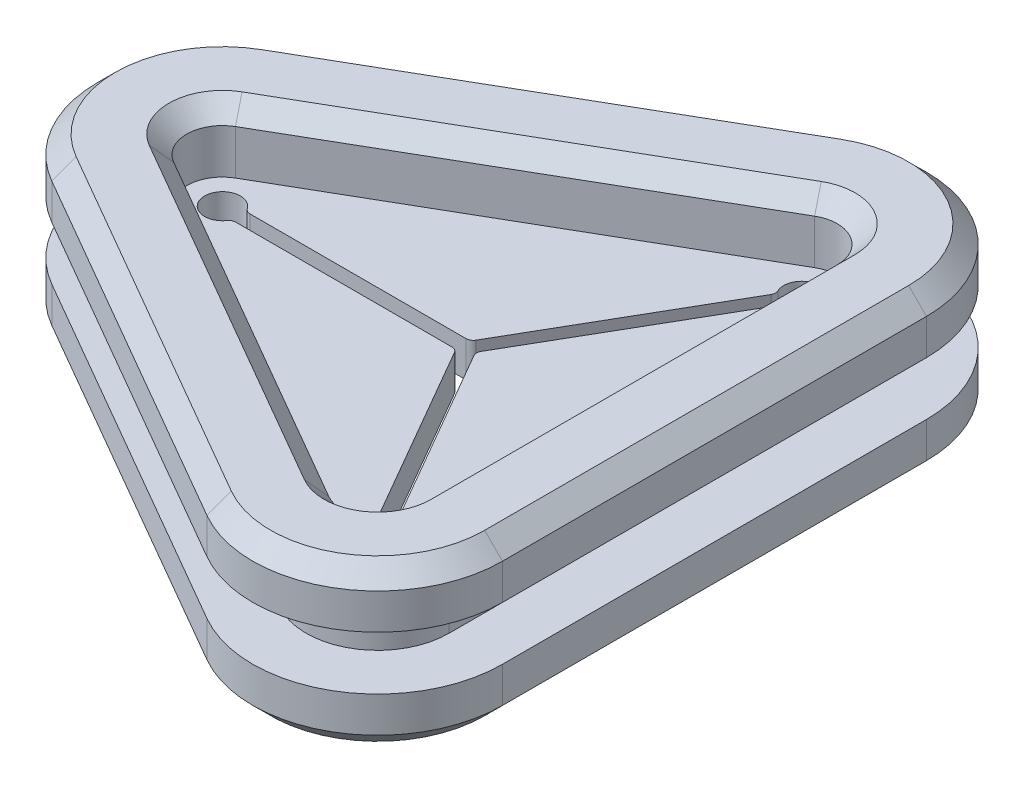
ISO-10303-21;
HEADER;
FILE_DESCRIPTION(('STEP AP214'),'2;1');
FILE_NAME('part.step','',(''),(''),'','','');
FILE_SCHEMA(('AUTOMOTIVE_DESIGN { 1 0 10303 214 1 1 1 1 }'));
ENDSEC;
DATA;
#1=APPLICATION_CONTEXT('core data for automotive mechanical design processes');
#2=APPLICATION_PROTOCOL_DEFINITION('international standard','automotive_design',2000,#1);
#3=PRODUCT_CONTEXT('',#1,'mechanical');
#4=PRODUCT('Part','Part','',(#3));
#5=PRODUCT_RELATED_PRODUCT_CATEGORY('part','',(#4));
#6=PRODUCT_DEFINITION_FORMATION('','',#4);
#7=PRODUCT_DEFINITION_CONTEXT('part definition',#1,'design');
#8=PRODUCT_DEFINITION('design','',#6,#7);
#9=PRODUCT_DEFINITION_SHAPE('','',#8);
#10=(LENGTH_UNIT() NAMED_UNIT(*) SI_UNIT(.MILLI.,.METRE.));
#11=(NAMED_UNIT(*) PLANE_ANGLE_UNIT() SI_UNIT($,.RADIAN.));
#12=(NAMED_UNIT(*) SI_UNIT($,.STERADIAN.) SOLID_ANGLE_UNIT());
#13=UNCERTAINTY_MEASURE_WITH_UNIT(LENGTH_MEASURE(1.E-05),#10,'distance_accuracy_value','');
#14=(GEOMETRIC_REPRESENTATION_CONTEXT(3) GLOBAL_UNCERTAINTY_ASSIGNED_CONTEXT((#13)) GLOBAL_UNIT_ASSIGNED_CONTEXT((#10,
#11,#12)) REPRESENTATION_CONTEXT('',''));
#15=CARTESIAN_POINT('',(0.,0.,0.));
#16=DIRECTION('',(0.,0.,1.));
#17=DIRECTION('',(1.,0.,0.));
#18=AXIS2_PLACEMENT_3D('',#15,#16,#17);
#19=CARTESIAN_POINT('',(-6.85754374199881,0.75,0.));
#20=DIRECTION('',(0.,1.,0.));
#21=DIRECTION('',(0.,0.,1.));
#22=AXIS2_PLACEMENT_3D('',#19,#20,#21);
#23=PLANE('',#22);
#24=CARTESIAN_POINT('',(3.4287718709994,0.75,-5.93880708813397));
#25=DIRECTION('',(0.,-1.,0.));
#26=DIRECTION('',(0.,0.,-1.));
#27=AXIS2_PLACEMENT_3D('',#24,#25,#26);
#28=CIRCLE('',#27,2.);
#29=CARTESIAN_POINT('',(2.4287718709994,0.75,-7.67085789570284));
#30=VERTEX_POINT('',#29);
#31=CARTESIAN_POINT('',(5.4287718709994,0.75,-5.93880708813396));
#32=VERTEX_POINT('',#31);
#33=EDGE_CURVE('E858',#30,#32,#28,.T.);
#34=ORIENTED_EDGE('',*,*,#33,.F.);
#35=DIRECTION('',(0.866025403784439,0.,-0.5));
#36=VECTOR('',#35,1.);
#37=CARTESIAN_POINT('',(5.4287718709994,0.75,-9.40290870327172));
#38=LINE('',#37,#36);
#39=CARTESIAN_POINT('',(-7.85754374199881,0.75,-1.73205080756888));
#40=VERTEX_POINT('',#39);
#41=EDGE_CURVE('E857',#30,#40,#38,.F.);
#42=ORIENTED_EDGE('',*,*,#41,.T.);
#43=CARTESIAN_POINT('',(-6.85754374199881,0.75,0.));
#44=DIRECTION('',(0.,-1.,0.));
#45=DIRECTION('',(0.,0.,-1.));
#46=AXIS2_PLACEMENT_3D('',#43,#44,#45);
#47=CIRCLE('',#46,2.);
#48=CARTESIAN_POINT('',(-7.85754374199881,0.75,1.73205080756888));
#49=VERTEX_POINT('',#48);
#50=EDGE_CURVE('E850',#49,#40,#47,.T.);
#51=ORIENTED_EDGE('',*,*,#50,.F.);
#52=DIRECTION('',(-0.866025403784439,0.,-0.5));
#53=VECTOR('',#52,1.);
#54=CARTESIAN_POINT('',(-10.8575437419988,0.75,0.));
#55=LINE('',#54,#53);
#56=CARTESIAN_POINT('',(2.42877187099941,0.75,7.67085789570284));
#57=VERTEX_POINT('',#56);
#58=EDGE_CURVE('E871',#49,#57,#55,.F.);
#59=ORIENTED_EDGE('',*,*,#58,.T.);
#60=CARTESIAN_POINT('',(3.42877187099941,0.75,5.93880708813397));
#61=DIRECTION('',(0.,-1.,0.));
#62=DIRECTION('',(0.,0.,-1.));
#63=AXIS2_PLACEMENT_3D('',#60,#61,#62);
#64=CIRCLE('',#63,2.);
#65=CARTESIAN_POINT('',(5.42877187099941,0.75,5.93880708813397));
#66=VERTEX_POINT('',#65);
#67=EDGE_CURVE('E20',#66,#57,#64,.T.);
#68=ORIENTED_EDGE('',*,*,#67,.F.);
#69=DIRECTION('',(0.,0.,1.));
#70=VECTOR('',#69,1.);
#71=CARTESIAN_POINT('',(5.42877187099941,0.75,9.40290870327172));
#72=LINE('',#71,#70);
#73=EDGE_CURVE('E862',#66,#32,#72,.F.);
#74=ORIENTED_EDGE('',*,*,#73,.T.);
#75=EDGE_LOOP('',(#34,#42,#51,#59,#68,#74));
#76=FACE_BOUND('',#75,.T.);
#77=DIRECTION('',(0.866025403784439,0.,-0.5));
#78=VECTOR('',#77,1.);
#79=CARTESIAN_POINT('',(1.6787718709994,0.749999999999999,-8.9698960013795));
#80=LINE('',#79,#78);
#81=CARTESIAN_POINT('',(-8.60754374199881,0.75,-3.03108891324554));
#82=VERTEX_POINT('',#81);
#83=CARTESIAN_POINT('',(1.6787718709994,0.75,-8.9698960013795));
#84=VERTEX_POINT('',#83);
#85=EDGE_CURVE('E841',#82,#84,#80,.T.);
#86=ORIENTED_EDGE('',*,*,#85,.T.);
#87=CARTESIAN_POINT('',(3.4287718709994,0.75,-5.93880708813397));
#88=DIRECTION('',(0.,-1.,0.));
#89=DIRECTION('',(0.,0.,-1.));
#90=AXIS2_PLACEMENT_3D('',#87,#88,#89);
#91=CIRCLE('',#90,3.5);
#92=CARTESIAN_POINT('',(6.9287718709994,0.75,-5.93880708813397));
#93=VERTEX_POINT('',#92);
#94=EDGE_CURVE('E853',#93,#84,#91,.F.);
#95=ORIENTED_EDGE('',*,*,#94,.F.);
#96=DIRECTION('',(0.,0.,1.));
#97=VECTOR('',#96,1.);
#98=CARTESIAN_POINT('',(6.92877187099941,0.75,5.93880708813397));
#99=LINE('',#98,#97);
#100=CARTESIAN_POINT('',(6.92877187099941,0.75,5.93880708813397));
#101=VERTEX_POINT('',#100);
#102=EDGE_CURVE('E813',#93,#101,#99,.T.);
#103=ORIENTED_EDGE('',*,*,#102,.T.);
#104=CARTESIAN_POINT('',(3.42877187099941,0.75,5.93880708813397));
#105=DIRECTION('',(0.,-1.,0.));
#106=DIRECTION('',(0.,0.,-1.));
#107=AXIS2_PLACEMENT_3D('',#104,#105,#106);
#108=CIRCLE('',#107,3.5);
#109=CARTESIAN_POINT('',(1.67877187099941,0.75,8.9698960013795));
#110=VERTEX_POINT('',#109);
#111=EDGE_CURVE('E822',#110,#101,#108,.F.);
#112=ORIENTED_EDGE('',*,*,#111,.F.);
#113=DIRECTION('',(-0.866025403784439,0.,-0.5));
#114=VECTOR('',#113,1.);
#115=CARTESIAN_POINT('',(-8.60754374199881,0.75,3.03108891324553));
#116=LINE('',#115,#114);
#117=CARTESIAN_POINT('',(-8.60754374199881,0.75,3.03108891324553));
#118=VERTEX_POINT('',#117);
#119=EDGE_CURVE('E831',#110,#118,#116,.T.);
#120=ORIENTED_EDGE('',*,*,#119,.T.);
#121=CARTESIAN_POINT('',(-6.85754374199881,0.75,0.));
#122=DIRECTION('',(0.,-1.,0.));
#123=DIRECTION('',(0.,0.,-1.));
#124=AXIS2_PLACEMENT_3D('',#121,#122,#123);
#125=CIRCLE('',#124,3.5);
#126=EDGE_CURVE('E840',#82,#118,#125,.F.);
#127=ORIENTED_EDGE('',*,*,#126,.F.);
#128=EDGE_LOOP('',(#86,#95,#103,#112,#120,#127));
#129=FACE_BOUND('',#128,.T.);
#130=ADVANCED_FACE('F17',(#76,#129),#23,.F.);
#131=CARTESIAN_POINT('',(-10.8575437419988,0.75,0.));
#132=DIRECTION('',(0.5,0.,-0.866025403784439));
#133=DIRECTION('',(-0.866025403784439,0.,-0.5));
#134=AXIS2_PLACEMENT_3D('',#131,#132,#133);
#135=PLANE('',#134);
#136=DIRECTION('',(0.,-1.,0.));
#137=VECTOR('',#136,1.);
#138=CARTESIAN_POINT('',(-7.85754374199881,0.75,1.73205080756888));
#139=LINE('',#138,#137);
#140=CARTESIAN_POINT('',(-7.85754374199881,-0.75,1.73205080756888));
#141=VERTEX_POINT('',#140);
#142=EDGE_CURVE('E849',#141,#49,#139,.F.);
#143=ORIENTED_EDGE('',*,*,#142,.F.);
#144=DIRECTION('',(0.866025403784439,0.,0.5));
#145=VECTOR('',#144,1.);
#146=CARTESIAN_POINT('',(-7.85754374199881,-0.75,1.73205080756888));
#147=LINE('',#146,#145);
#148=CARTESIAN_POINT('',(2.42877187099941,-0.75,7.67085789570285));
#149=VERTEX_POINT('',#148);
#150=EDGE_CURVE('E787',#141,#149,#147,.T.);
#151=ORIENTED_EDGE('',*,*,#150,.T.);
#152=DIRECTION('',(0.,-1.,0.));
#153=VECTOR('',#152,1.);
#154=CARTESIAN_POINT('',(2.42877187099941,0.75,7.67085789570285));
#155=LINE('',#154,#153);
#156=EDGE_CURVE('E866',#57,#149,#155,.T.);
#157=ORIENTED_EDGE('',*,*,#156,.F.);
#158=ORIENTED_EDGE('',*,*,#58,.F.);
#159=EDGE_LOOP('',(#143,#151,#157,#158));
#160=FACE_BOUND('',#159,.T.);
#161=ADVANCED_FACE('F1027',(#160),#135,.F.);
#162=CARTESIAN_POINT('',(3.42877187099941,0.75,5.93880708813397));
#163=DIRECTION('',(0.,-1.,0.));
#164=DIRECTION('',(0.,0.,-1.));
#165=AXIS2_PLACEMENT_3D('',#162,#163,#164);
#166=CYLINDRICAL_SURFACE('',#165,2.);
#167=CARTESIAN_POINT('',(3.42877187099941,-0.75,5.93880708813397));
#168=DIRECTION('',(0.,-1.,0.));
#169=DIRECTION('',(0.,0.,-1.));
#170=AXIS2_PLACEMENT_3D('',#167,#168,#169);
#171=CIRCLE('',#170,2.);
#172=CARTESIAN_POINT('',(5.42877187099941,-0.75,5.93880708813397));
#173=VERTEX_POINT('',#172);
#174=EDGE_CURVE('E786',#149,#173,#171,.F.);
#175=ORIENTED_EDGE('',*,*,#174,.T.);
#176=DIRECTION('',(0.,1.,0.));
#177=VECTOR('',#176,1.);
#178=CARTESIAN_POINT('',(5.42877187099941,0.75,5.93880708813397));
#179=LINE('',#178,#177);
#180=EDGE_CURVE('E863',#173,#66,#179,.T.);
#181=ORIENTED_EDGE('',*,*,#180,.T.);
#182=ORIENTED_EDGE('',*,*,#67,.T.);
#183=ORIENTED_EDGE('',*,*,#156,.T.);
#184=EDGE_LOOP('',(#175,#181,#182,#183));
#185=FACE_BOUND('',#184,.T.);
#186=ADVANCED_FACE('F1023',(#185),#166,.T.);
#187=CARTESIAN_POINT('',(5.42877187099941,0.75,9.40290870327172));
#188=DIRECTION('',(-1.,0.,0.));
#189=DIRECTION('',(0.,0.,1.));
#190=AXIS2_PLACEMENT_3D('',#187,#188,#189);
#191=PLANE('',#190);
#192=DIRECTION('',(0.,-1.,0.));
#193=VECTOR('',#192,1.);
#194=CARTESIAN_POINT('',(5.4287718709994,0.75,-5.93880708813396));
#195=LINE('',#194,#193);
#196=CARTESIAN_POINT('',(5.4287718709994,-0.75,-5.93880708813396));
#197=VERTEX_POINT('',#196);
#198=EDGE_CURVE('E859',#32,#197,#195,.T.);
#199=ORIENTED_EDGE('',*,*,#198,.F.);
#200=ORIENTED_EDGE('',*,*,#73,.F.);
#201=ORIENTED_EDGE('',*,*,#180,.F.);
#202=DIRECTION('',(0.,0.,-1.));
#203=VECTOR('',#202,1.);
#204=CARTESIAN_POINT('',(5.42877187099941,-0.75,-5.93880708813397));
#205=LINE('',#204,#203);
#206=EDGE_CURVE('E783',#173,#197,#205,.T.);
#207=ORIENTED_EDGE('',*,*,#206,.T.);
#208=EDGE_LOOP('',(#199,#200,#201,#207));
#209=FACE_BOUND('',#208,.T.);
#210=ADVANCED_FACE('F1015',(#209),#191,.F.);
#211=CARTESIAN_POINT('',(3.4287718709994,0.75,-5.93880708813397));
#212=DIRECTION('',(0.,-1.,0.));
#213=DIRECTION('',(0.,0.,-1.));
#214=AXIS2_PLACEMENT_3D('',#211,#212,#213);
#215=CYLINDRICAL_SURFACE('',#214,2.);
#216=CARTESIAN_POINT('',(3.4287718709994,-0.75,-5.93880708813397));
#217=DIRECTION('',(0.,-1.,0.));
#218=DIRECTION('',(0.,0.,-1.));
#219=AXIS2_PLACEMENT_3D('',#216,#217,#218);
#220=CIRCLE('',#219,2.);
#221=CARTESIAN_POINT('',(2.4287718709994,-0.75,-7.67085789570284));
#222=VERTEX_POINT('',#221);
#223=EDGE_CURVE('E782',#197,#222,#220,.F.);
#224=ORIENTED_EDGE('',*,*,#223,.T.);
#225=DIRECTION('',(0.,1.,0.));
#226=VECTOR('',#225,1.);
#227=CARTESIAN_POINT('',(2.4287718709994,0.75,-7.67085789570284));
#228=LINE('',#227,#226);
#229=EDGE_CURVE('E854',#222,#30,#228,.T.);
#230=ORIENTED_EDGE('',*,*,#229,.T.);
#231=ORIENTED_EDGE('',*,*,#33,.T.);
#232=ORIENTED_EDGE('',*,*,#198,.T.);
#233=EDGE_LOOP('',(#224,#230,#231,#232));
#234=FACE_BOUND('',#233,.T.);
#235=ADVANCED_FACE('F1008',(#234),#215,.T.);
#236=CARTESIAN_POINT('',(5.4287718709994,0.75,-9.40290870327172));
#237=DIRECTION('',(0.5,0.,0.866025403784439));
#238=DIRECTION('',(0.866025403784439,0.,-0.5));
#239=AXIS2_PLACEMENT_3D('',#236,#237,#238);
#240=PLANE('',#239);
#241=ORIENTED_EDGE('',*,*,#229,.F.);
#242=DIRECTION('',(-0.866025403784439,0.,0.5));
#243=VECTOR('',#242,1.);
#244=CARTESIAN_POINT('',(2.4287718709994,-0.75,-7.67085789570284));
#245=LINE('',#244,#243);
#246=CARTESIAN_POINT('',(-7.85754374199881,-0.75,-1.73205080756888));
#247=VERTEX_POINT('',#246);
#248=EDGE_CURVE('E778',#222,#247,#245,.T.);
#249=ORIENTED_EDGE('',*,*,#248,.T.);
#250=DIRECTION('',(0.,-1.,0.));
#251=VECTOR('',#250,1.);
#252=CARTESIAN_POINT('',(-7.85754374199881,0.75,-1.73205080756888));
#253=LINE('',#252,#251);
#254=EDGE_CURVE('E847',#40,#247,#253,.T.);
#255=ORIENTED_EDGE('',*,*,#254,.F.);
#256=ORIENTED_EDGE('',*,*,#41,.F.);
#257=EDGE_LOOP('',(#241,#249,#255,#256));
#258=FACE_BOUND('',#257,.T.);
#259=ADVANCED_FACE('F1032',(#258),#240,.F.);
#260=CARTESIAN_POINT('',(-6.85754374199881,0.75,0.));
#261=DIRECTION('',(0.,-1.,0.));
#262=DIRECTION('',(0.,0.,-1.));
#263=AXIS2_PLACEMENT_3D('',#260,#261,#262);
#264=CYLINDRICAL_SURFACE('',#263,2.);
#265=CARTESIAN_POINT('',(-6.85754374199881,-0.75,0.));
#266=DIRECTION('',(0.,-1.,0.));
#267=DIRECTION('',(0.,0.,-1.));
#268=AXIS2_PLACEMENT_3D('',#265,#266,#267);
#269=CIRCLE('',#268,2.);
#270=EDGE_CURVE('E781',#247,#141,#269,.F.);
#271=ORIENTED_EDGE('',*,*,#270,.T.);
#272=ORIENTED_EDGE('',*,*,#142,.T.);
#273=ORIENTED_EDGE('',*,*,#50,.T.);
#274=ORIENTED_EDGE('',*,*,#254,.T.);
#275=EDGE_LOOP('',(#271,#272,#273,#274));
#276=FACE_BOUND('',#275,.T.);
#277=ADVANCED_FACE('F1034',(#276),#264,.T.);
#278=CARTESIAN_POINT('',(3.4287718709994,2.25,-5.93880708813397));
#279=DIRECTION('',(0.,-1.,0.));
#280=DIRECTION('',(0.,0.,-1.));
#281=AXIS2_PLACEMENT_3D('',#278,#279,#280);
#282=CYLINDRICAL_SURFACE('',#281,3.5);
#283=DIRECTION('',(0.,1.,0.));
#284=VECTOR('',#283,1.);
#285=CARTESIAN_POINT('',(6.9287718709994,2.25,-5.93880708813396));
#286=LINE('',#285,#284);
#287=CARTESIAN_POINT('',(6.92877187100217,1.75000000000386,-5.93880708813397));
#288=VERTEX_POINT('',#287);
#289=EDGE_CURVE('E790',#288,#93,#286,.F.);
#290=ORIENTED_EDGE('',*,*,#289,.T.);
#291=ORIENTED_EDGE('',*,*,#94,.T.);
#292=DIRECTION('',(0.,-1.,0.));
#293=VECTOR('',#292,1.);
#294=CARTESIAN_POINT('',(1.6787718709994,2.25,-8.9698960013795));
#295=LINE('',#294,#293);
#296=CARTESIAN_POINT('',(1.6787718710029,1.75000000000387,-8.96989600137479));
#297=VERTEX_POINT('',#296);
#298=EDGE_CURVE('E888',#84,#297,#295,.F.);
#299=ORIENTED_EDGE('',*,*,#298,.T.);
#300=CARTESIAN_POINT('',(3.4287718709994,1.75000000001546,-5.93880708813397));
#301=DIRECTION('',(0.,-1.,0.));
#302=DIRECTION('',(0.,0.,-1.));
#303=AXIS2_PLACEMENT_3D('',#300,#301,#302);
#304=CIRCLE('',#303,3.50000000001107);
#305=EDGE_CURVE('E337',#288,#297,#304,.F.);
#306=ORIENTED_EDGE('',*,*,#305,.F.);
#307=EDGE_LOOP('',(#290,#291,#299,#306));
#308=FACE_BOUND('',#307,.T.);
#309=ADVANCED_FACE('F1036',(#308),#282,.T.);
#310=CARTESIAN_POINT('',(1.6787718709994,2.25,-8.9698960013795));
#311=DIRECTION('',(0.5,0.,0.866025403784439));
#312=DIRECTION('',(0.866025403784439,0.,-0.5));
#313=AXIS2_PLACEMENT_3D('',#310,#311,#312);
#314=PLANE('',#313);
#315=DIRECTION('',(-0.866025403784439,0.,0.5));
#316=VECTOR('',#315,1.);
#317=CARTESIAN_POINT('',(1.67877187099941,1.75,-8.9698960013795));
#318=LINE('',#317,#316);
#319=CARTESIAN_POINT('',(-8.60754374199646,1.7500000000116,-3.03108891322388));
#320=VERTEX_POINT('',#319);
#321=EDGE_CURVE('E773',#297,#320,#318,.T.);
#322=ORIENTED_EDGE('',*,*,#321,.F.);
#323=ORIENTED_EDGE('',*,*,#298,.F.);
#324=ORIENTED_EDGE('',*,*,#85,.F.);
#325=DIRECTION('',(0.,-1.,0.));
#326=VECTOR('',#325,1.);
#327=CARTESIAN_POINT('',(-8.60754374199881,2.25,-3.03108891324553));
#328=LINE('',#327,#326);
#329=EDGE_CURVE('E837',#320,#82,#328,.T.);
#330=ORIENTED_EDGE('',*,*,#329,.F.);
#331=EDGE_LOOP('',(#322,#323,#324,#330));
#332=FACE_BOUND('',#331,.T.);
#333=ADVANCED_FACE('F1043',(#332),#314,.F.);
#334=CARTESIAN_POINT('',(-6.85754374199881,2.25,0.));
#335=DIRECTION('',(0.,-1.,0.));
#336=DIRECTION('',(0.,0.,-1.));
#337=AXIS2_PLACEMENT_3D('',#334,#335,#336);
#338=CYLINDRICAL_SURFACE('',#337,3.5);
#339=ORIENTED_EDGE('',*,*,#329,.T.);
#340=ORIENTED_EDGE('',*,*,#126,.T.);
#341=DIRECTION('',(0.,1.,0.));
#342=VECTOR('',#341,1.);
#343=CARTESIAN_POINT('',(-8.60754374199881,2.25,3.03108891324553));
#344=LINE('',#343,#342);
#345=CARTESIAN_POINT('',(-8.60754374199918,1.75000000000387,3.03108891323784));
#346=VERTEX_POINT('',#345);
#347=EDGE_CURVE('E823',#118,#346,#344,.T.);
#348=ORIENTED_EDGE('',*,*,#347,.T.);
#349=CARTESIAN_POINT('',(-6.85754374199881,1.75000000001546,0.));
#350=DIRECTION('',(0.,-1.,0.));
#351=DIRECTION('',(0.,0.,-1.));
#352=AXIS2_PLACEMENT_3D('',#349,#350,#351);
#353=CIRCLE('',#352,3.49999999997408);
#354=EDGE_CURVE('E767',#320,#346,#353,.F.);
#355=ORIENTED_EDGE('',*,*,#354,.F.);
#356=EDGE_LOOP('',(#339,#340,#348,#355));
#357=FACE_BOUND('',#356,.T.);
#358=ADVANCED_FACE('F1310',(#357),#338,.T.);
#359=CARTESIAN_POINT('',(-8.60754374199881,2.25,3.03108891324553));
#360=DIRECTION('',(0.5,0.,-0.866025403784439));
#361=DIRECTION('',(-0.866025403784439,0.,-0.5));
#362=AXIS2_PLACEMENT_3D('',#359,#360,#361);
#363=PLANE('',#362);
#364=DIRECTION('',(0.866025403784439,0.,0.5));
#365=VECTOR('',#364,1.);
#366=CARTESIAN_POINT('',(-8.60754374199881,1.75,3.03108891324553));
#367=LINE('',#366,#365);
#368=CARTESIAN_POINT('',(1.67877187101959,1.75000000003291,8.96989600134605));
#369=VERTEX_POINT('',#368);
#370=EDGE_CURVE('E761',#346,#369,#367,.T.);
#371=ORIENTED_EDGE('',*,*,#370,.F.);
#372=ORIENTED_EDGE('',*,*,#347,.F.);
#373=ORIENTED_EDGE('',*,*,#119,.F.);
#374=DIRECTION('',(0.,-1.,0.));
#375=VECTOR('',#374,1.);
#376=CARTESIAN_POINT('',(1.67877187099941,2.25,8.9698960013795));
#377=LINE('',#376,#375);
#378=EDGE_CURVE('E819',#369,#110,#377,.T.);
#379=ORIENTED_EDGE('',*,*,#378,.F.);
#380=EDGE_LOOP('',(#371,#372,#373,#379));
#381=FACE_BOUND('',#380,.T.);
#382=ADVANCED_FACE('F1306',(#381),#363,.F.);
#383=CARTESIAN_POINT('',(3.42877187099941,2.25,5.93880708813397));
#384=DIRECTION('',(0.,-1.,0.));
#385=DIRECTION('',(0.,0.,-1.));
#386=AXIS2_PLACEMENT_3D('',#383,#384,#385);
#387=CYLINDRICAL_SURFACE('',#386,3.5);
#388=ORIENTED_EDGE('',*,*,#378,.T.);
#389=ORIENTED_EDGE('',*,*,#111,.T.);
#390=DIRECTION('',(0.,1.,0.));
#391=VECTOR('',#390,1.);
#392=CARTESIAN_POINT('',(6.92877187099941,2.25,5.93880708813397));
#393=LINE('',#392,#391);
#394=CARTESIAN_POINT('',(6.92877187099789,1.75000000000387,5.93880708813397));
#395=VERTEX_POINT('',#394);
#396=EDGE_CURVE('E808',#101,#395,#393,.T.);
#397=ORIENTED_EDGE('',*,*,#396,.T.);
#398=CARTESIAN_POINT('',(3.42877187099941,1.75000000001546,5.93880708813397));
#399=DIRECTION('',(0.,-1.,0.));
#400=DIRECTION('',(0.,0.,-1.));
#401=AXIS2_PLACEMENT_3D('',#398,#399,#400);
#402=CIRCLE('',#401,3.49999999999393);
#403=EDGE_CURVE('E751',#369,#395,#402,.F.);
#404=ORIENTED_EDGE('',*,*,#403,.F.);
#405=EDGE_LOOP('',(#388,#389,#397,#404));
#406=FACE_BOUND('',#405,.T.);
#407=ADVANCED_FACE('F1302',(#406),#387,.T.);
#408=CARTESIAN_POINT('',(6.92877187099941,2.25,5.93880708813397));
#409=DIRECTION('',(-1.,0.,0.));
#410=DIRECTION('',(0.,0.,1.));
#411=AXIS2_PLACEMENT_3D('',#408,#409,#410);
#412=PLANE('',#411);
#413=DIRECTION('',(0.,0.,1.));
#414=VECTOR('',#413,1.);
#415=CARTESIAN_POINT('',(6.92877187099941,1.75,0.));
#416=LINE('',#415,#414);
#417=EDGE_CURVE('E750',#395,#288,#416,.F.);
#418=ORIENTED_EDGE('',*,*,#417,.F.);
#419=ORIENTED_EDGE('',*,*,#396,.F.);
#420=ORIENTED_EDGE('',*,*,#102,.F.);
#421=ORIENTED_EDGE('',*,*,#289,.F.);
#422=EDGE_LOOP('',(#418,#419,#420,#421));
#423=FACE_BOUND('',#422,.T.);
#424=ADVANCED_FACE('F1299',(#423),#412,.F.);
#425=CARTESIAN_POINT('',(3.4287718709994,-0.75,-5.93880708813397));
#426=DIRECTION('',(0.,-1.,0.));
#427=DIRECTION('',(0.,0.,-1.));
#428=AXIS2_PLACEMENT_3D('',#425,#426,#427);
#429=PLANE('',#428);
#430=ORIENTED_EDGE('',*,*,#248,.F.);
#431=ORIENTED_EDGE('',*,*,#223,.F.);
#432=ORIENTED_EDGE('',*,*,#206,.F.);
#433=ORIENTED_EDGE('',*,*,#174,.F.);
#434=ORIENTED_EDGE('',*,*,#150,.F.);
#435=ORIENTED_EDGE('',*,*,#270,.F.);
#436=EDGE_LOOP('',(#430,#431,#432,#433,#434,#435));
#437=FACE_BOUND('',#436,.T.);
#438=DIRECTION('',(0.866025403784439,0.,-0.5));
#439=VECTOR('',#438,1.);
#440=CARTESIAN_POINT('',(-8.60754374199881,-0.75,-3.03108891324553));
#441=LINE('',#440,#439);
#442=CARTESIAN_POINT('',(1.6787718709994,-0.75,-8.9698960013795));
#443=VERTEX_POINT('',#442);
#444=CARTESIAN_POINT('',(-8.60754374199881,-0.75,-3.03108891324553));
#445=VERTEX_POINT('',#444);
#446=EDGE_CURVE('E728',#443,#445,#441,.F.);
#447=ORIENTED_EDGE('',*,*,#446,.T.);
#448=CARTESIAN_POINT('',(-6.85754374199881,-0.75,0.));
#449=DIRECTION('',(0.,1.,0.));
#450=DIRECTION('',(0.,0.,1.));
#451=AXIS2_PLACEMENT_3D('',#448,#449,#450);
#452=CIRCLE('',#451,3.5);
#453=CARTESIAN_POINT('',(-8.60754374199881,-0.75,3.03108891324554));
#454=VERTEX_POINT('',#453);
#455=EDGE_CURVE('E734',#454,#445,#452,.F.);
#456=ORIENTED_EDGE('',*,*,#455,.F.);
#457=DIRECTION('',(-0.866025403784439,0.,-0.5));
#458=VECTOR('',#457,1.);
#459=CARTESIAN_POINT('',(1.67877187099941,-0.75,8.9698960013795));
#460=LINE('',#459,#458);
#461=CARTESIAN_POINT('',(1.67877187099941,-0.75,8.9698960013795));
#462=VERTEX_POINT('',#461);
#463=EDGE_CURVE('E692',#454,#462,#460,.F.);
#464=ORIENTED_EDGE('',*,*,#463,.T.);
#465=CARTESIAN_POINT('',(3.42877187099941,-0.75,5.93880708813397));
#466=DIRECTION('',(0.,1.,0.));
#467=DIRECTION('',(0.,0.,1.));
#468=AXIS2_PLACEMENT_3D('',#465,#466,#467);
#469=CIRCLE('',#468,3.5);
#470=CARTESIAN_POINT('',(6.92877187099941,-0.75,5.93880708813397));
#471=VERTEX_POINT('',#470);
#472=EDGE_CURVE('E701',#471,#462,#469,.F.);
#473=ORIENTED_EDGE('',*,*,#472,.F.);
#474=DIRECTION('',(0.,0.,1.));
#475=VECTOR('',#474,1.);
#476=CARTESIAN_POINT('',(6.9287718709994,-0.75,-5.93880708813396));
#477=LINE('',#476,#475);
#478=CARTESIAN_POINT('',(6.9287718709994,-0.75,-5.93880708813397));
#479=VERTEX_POINT('',#478);
#480=EDGE_CURVE('E710',#471,#479,#477,.F.);
#481=ORIENTED_EDGE('',*,*,#480,.T.);
#482=CARTESIAN_POINT('',(3.4287718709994,-0.75,-5.93880708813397));
#483=DIRECTION('',(0.,1.,0.));
#484=DIRECTION('',(0.,0.,1.));
#485=AXIS2_PLACEMENT_3D('',#482,#483,#484);
#486=CIRCLE('',#485,3.5);
#487=EDGE_CURVE('E719',#443,#479,#486,.F.);
#488=ORIENTED_EDGE('',*,*,#487,.F.);
#489=EDGE_LOOP('',(#447,#456,#464,#473,#481,#488));
#490=FACE_BOUND('',#489,.T.);
#491=ADVANCED_FACE('F1020',(#437,#490),#429,.F.);
#492=CARTESIAN_POINT('',(3.4287718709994,1.75000000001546,-5.93880708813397));
#493=DIRECTION('',(0.,-1.,0.));
#494=DIRECTION('',(0.,0.,-1.));
#495=AXIS2_PLACEMENT_3D('',#492,#493,#494);
#496=CONICAL_SURFACE('',#495,3.50000000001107,0.785398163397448);
#497=DIRECTION('',(-0.707106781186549,0.707106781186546,0.));
#498=VECTOR('',#497,1.);
#499=CARTESIAN_POINT('',(6.4287718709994,2.25,-5.93880708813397));
#500=LINE('',#499,#498);
#501=CARTESIAN_POINT('',(6.42877187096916,2.25000000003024,-5.93880708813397));
#502=VERTEX_POINT('',#501);
#503=EDGE_CURVE('E754',#288,#502,#500,.T.);
#504=ORIENTED_EDGE('',*,*,#503,.F.);
#505=ORIENTED_EDGE('',*,*,#305,.T.);
#506=DIRECTION('',(0.353553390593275,0.707106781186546,0.612372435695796));
#507=VECTOR('',#506,1.);
#508=CARTESIAN_POINT('',(-249493.601824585,-498988.81119291,-432147.472137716));
#509=LINE('',#508,#507);
#510=CARTESIAN_POINT('',(1.92877187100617,2.25000000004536,-8.53688329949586));
#511=VERTEX_POINT('',#510);
#512=EDGE_CURVE('E893',#297,#511,#509,.T.);
#513=ORIENTED_EDGE('',*,*,#512,.T.);
#514=CARTESIAN_POINT('',(3.4287718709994,2.25000000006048,-5.93880708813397));
#515=DIRECTION('',(0.,-1.,0.));
#516=DIRECTION('',(0.,0.,-1.));
#517=AXIS2_PLACEMENT_3D('',#514,#515,#516);
#518=CIRCLE('',#517,2.99999999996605);
#519=EDGE_CURVE('E677',#502,#511,#518,.F.);
#520=ORIENTED_EDGE('',*,*,#519,.F.);
#521=EDGE_LOOP('',(#504,#505,#513,#520));
#522=FACE_BOUND('',#521,.T.);
#523=ADVANCED_FACE('F1293',(#522),#496,.T.);
#524=CARTESIAN_POINT('',(-8.35754374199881,2.25,-2.59807621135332));
#525=DIRECTION('',(-0.353553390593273,0.707106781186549,-0.612372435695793));
#526=DIRECTION('',(0.,0.654653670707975,0.755928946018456));
#527=AXIS2_PLACEMENT_3D('',#524,#525,#526);
#528=PLANE('',#527);
#529=DIRECTION('',(0.353553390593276,0.707106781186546,0.612372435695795));
#530=VECTOR('',#529,1.);
#531=CARTESIAN_POINT('',(-249506.857543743,-498994.749999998,-432146.676488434));
#532=LINE('',#531,#530);
#533=CARTESIAN_POINT('',(-8.35754374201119,2.24999999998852,-2.59807621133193));
#534=VERTEX_POINT('',#533);
#535=EDGE_CURVE('E770',#534,#320,#532,.F.);
#536=ORIENTED_EDGE('',*,*,#535,.F.);
#537=DIRECTION('',(-0.866025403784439,0.,0.5));
#538=VECTOR('',#537,1.);
#539=CARTESIAN_POINT('',(1.9287718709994,2.25,-8.53688329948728));
#540=LINE('',#539,#538);
#541=EDGE_CURVE('E675',#511,#534,#540,.T.);
#542=ORIENTED_EDGE('',*,*,#541,.F.);
#543=ORIENTED_EDGE('',*,*,#512,.F.);
#544=ORIENTED_EDGE('',*,*,#321,.T.);
#545=EDGE_LOOP('',(#536,#542,#543,#544));
#546=FACE_BOUND('',#545,.T.);
#547=ADVANCED_FACE('F1289',(#546),#528,.T.);
#548=CARTESIAN_POINT('',(-6.85754374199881,1.75000000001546,0.));
#549=DIRECTION('',(0.,-1.,0.));
#550=DIRECTION('',(0.,0.,-1.));
#551=AXIS2_PLACEMENT_3D('',#548,#549,#550);
#552=CONICAL_SURFACE('',#551,3.49999999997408,0.785398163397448);
#553=ORIENTED_EDGE('',*,*,#535,.T.);
#554=ORIENTED_EDGE('',*,*,#354,.T.);
#555=DIRECTION('',(-0.353553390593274,-0.707106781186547,0.612372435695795));
#556=VECTOR('',#555,1.);
#557=CARTESIAN_POINT('',(-8.35754374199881,2.25,2.59807621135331));
#558=LINE('',#557,#556);
#559=CARTESIAN_POINT('',(-8.3575437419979,2.25000000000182,2.59807621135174));
#560=VERTEX_POINT('',#559);
#561=EDGE_CURVE('E764',#560,#346,#558,.T.);
#562=ORIENTED_EDGE('',*,*,#561,.F.);
#563=CARTESIAN_POINT('',(-6.85754374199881,2.25000000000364,0.));
#564=DIRECTION('',(0.,-1.,0.));
#565=DIRECTION('',(0.,0.,-1.));
#566=AXIS2_PLACEMENT_3D('',#563,#564,#565);
#567=CIRCLE('',#566,2.9999999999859);
#568=EDGE_CURVE('E674',#534,#560,#567,.F.);
#569=ORIENTED_EDGE('',*,*,#568,.F.);
#570=EDGE_LOOP('',(#553,#554,#562,#569));
#571=FACE_BOUND('',#570,.T.);
#572=ADVANCED_FACE('F1285',(#571),#552,.T.);
#573=CARTESIAN_POINT('',(-8.35754374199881,2.25,2.59807621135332));
#574=DIRECTION('',(-0.353553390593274,0.707106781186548,0.612372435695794));
#575=DIRECTION('',(0.,-0.654653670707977,0.755928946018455));
#576=AXIS2_PLACEMENT_3D('',#573,#574,#575);
#577=PLANE('',#576);
#578=ORIENTED_EDGE('',*,*,#561,.T.);
#579=ORIENTED_EDGE('',*,*,#370,.T.);
#580=DIRECTION('',(0.353553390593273,0.707106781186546,-0.612372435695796));
#581=VECTOR('',#580,1.);
#582=CARTESIAN_POINT('',(-249499.196228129,-499000.,432157.161928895));
#583=LINE('',#582,#581);
#584=CARTESIAN_POINT('',(1.92877187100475,2.24999999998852,8.53688329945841));
#585=VERTEX_POINT('',#584);
#586=EDGE_CURVE('E758',#585,#369,#583,.F.);
#587=ORIENTED_EDGE('',*,*,#586,.F.);
#588=DIRECTION('',(0.866025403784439,0.,0.5));
#589=VECTOR('',#588,1.);
#590=CARTESIAN_POINT('',(-8.35754374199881,2.25,2.59807621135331));
#591=LINE('',#590,#589);
#592=EDGE_CURVE('E672',#560,#585,#591,.T.);
#593=ORIENTED_EDGE('',*,*,#592,.F.);
#594=EDGE_LOOP('',(#578,#579,#587,#593));
#595=FACE_BOUND('',#594,.T.);
#596=ADVANCED_FACE('F1281',(#595),#577,.T.);
#597=CARTESIAN_POINT('',(3.42877187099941,1.75000000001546,5.93880708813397));
#598=DIRECTION('',(0.,-1.,0.));
#599=DIRECTION('',(0.,0.,-1.));
#600=AXIS2_PLACEMENT_3D('',#597,#598,#599);
#601=CONICAL_SURFACE('',#600,3.49999999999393,0.785398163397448);
#602=DIRECTION('',(-0.707106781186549,0.707106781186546,0.));
#603=VECTOR('',#602,1.);
#604=CARTESIAN_POINT('',(6.4287718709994,2.25,5.93880708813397));
#605=LINE('',#604,#603);
#606=CARTESIAN_POINT('',(6.42877187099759,2.25000000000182,5.93880708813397));
#607=VERTEX_POINT('',#606);
#608=EDGE_CURVE('E747',#607,#395,#605,.F.);
#609=ORIENTED_EDGE('',*,*,#608,.F.);
#610=CARTESIAN_POINT('',(3.42877187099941,2.25000000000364,5.93880708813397));
#611=DIRECTION('',(0.,-1.,0.));
#612=DIRECTION('',(0.,0.,-1.));
#613=AXIS2_PLACEMENT_3D('',#610,#611,#612);
#614=CIRCLE('',#613,3.00000000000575);
#615=EDGE_CURVE('E671',#585,#607,#614,.F.);
#616=ORIENTED_EDGE('',*,*,#615,.F.);
#617=ORIENTED_EDGE('',*,*,#586,.T.);
#618=ORIENTED_EDGE('',*,*,#403,.T.);
#619=EDGE_LOOP('',(#609,#616,#617,#618));
#620=FACE_BOUND('',#619,.T.);
#621=ADVANCED_FACE('F1277',(#620),#601,.T.);
#622=CARTESIAN_POINT('',(6.4287718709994,2.25,0.));
#623=DIRECTION('',(0.707106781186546,0.707106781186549,0.));
#624=DIRECTION('',(-0.707106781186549,0.707106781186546,0.));
#625=AXIS2_PLACEMENT_3D('',#622,#623,#624);
#626=PLANE('',#625);
#627=ORIENTED_EDGE('',*,*,#503,.T.);
#628=DIRECTION('',(0.,0.,1.));
#629=VECTOR('',#628,1.);
#630=CARTESIAN_POINT('',(6.42877187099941,2.25,0.));
#631=LINE('',#630,#629);
#632=EDGE_CURVE('E667',#607,#502,#631,.F.);
#633=ORIENTED_EDGE('',*,*,#632,.F.);
#634=ORIENTED_EDGE('',*,*,#608,.T.);
#635=ORIENTED_EDGE('',*,*,#417,.T.);
#636=EDGE_LOOP('',(#627,#633,#634,#635));
#637=FACE_BOUND('',#636,.T.);
#638=ADVANCED_FACE('F1273',(#637),#626,.T.);
#639=CARTESIAN_POINT('',(3.4287718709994,2.25000000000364,-5.93880708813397));
#640=DIRECTION('',(0.,1.,0.));
#641=DIRECTION('',(0.,0.,1.));
#642=AXIS2_PLACEMENT_3D('',#639,#640,#641);
#643=CONICAL_SURFACE('',#642,1.50000000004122,0.785398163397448);
#644=CARTESIAN_POINT('',(3.4287718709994,2.25000000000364,-5.93880708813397));
#645=DIRECTION('',(0.,1.,0.));
#646=DIRECTION('',(0.,0.,1.));
#647=AXIS2_PLACEMENT_3D('',#644,#645,#646);
#648=CIRCLE('',#647,1.50000000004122);
#649=CARTESIAN_POINT('',(2.67877187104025,2.2499999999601,-7.23784519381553));
#650=VERTEX_POINT('',#649);
#651=CARTESIAN_POINT('',(4.92877187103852,2.25000000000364,-5.93880708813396));
#652=VERTEX_POINT('',#651);
#653=EDGE_CURVE('E670',#650,#652,#648,.F.);
#654=ORIENTED_EDGE('',*,*,#653,.F.);
#655=DIRECTION('',(0.353553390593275,-0.707106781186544,0.612372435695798));
#656=VECTOR('',#655,1.);
#657=CARTESIAN_POINT('',(-249496.196228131,499000.,-432151.965776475));
#658=LINE('',#657,#656);
#659=CARTESIAN_POINT('',(2.92877187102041,1.75000000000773,-6.80483249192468));
#660=VERTEX_POINT('',#659);
#661=EDGE_CURVE('E738',#660,#650,#658,.F.);
#662=ORIENTED_EDGE('',*,*,#661,.F.);
#663=CARTESIAN_POINT('',(3.4287718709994,1.75000000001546,-5.93880708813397));
#664=DIRECTION('',(0.,1.,0.));
#665=DIRECTION('',(0.,0.,1.));
#666=AXIS2_PLACEMENT_3D('',#663,#664,#665);
#667=CIRCLE('',#666,0.999999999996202);
#668=CARTESIAN_POINT('',(4.42877187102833,1.75000000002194,-5.93880708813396));
#669=VERTEX_POINT('',#668);
#670=EDGE_CURVE('E740',#669,#660,#667,.T.);
#671=ORIENTED_EDGE('',*,*,#670,.F.);
#672=DIRECTION('',(-0.707106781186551,-0.707106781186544,0.));
#673=VECTOR('',#672,1.);
#674=CARTESIAN_POINT('',(499002.678771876,499000.,-5.93880708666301));
#675=LINE('',#674,#673);
#676=EDGE_CURVE('E735',#652,#669,#675,.T.);
#677=ORIENTED_EDGE('',*,*,#676,.F.);
#678=EDGE_LOOP('',(#654,#662,#671,#677));
#679=FACE_BOUND('',#678,.T.);
#680=ADVANCED_FACE('F1269',(#679),#643,.F.);
#681=CARTESIAN_POINT('',(-6.85754374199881,-2.25,0.));
#682=DIRECTION('',(0.,1.,0.));
#683=DIRECTION('',(0.,0.,1.));
#684=AXIS2_PLACEMENT_3D('',#681,#682,#683);
#685=CYLINDRICAL_SURFACE('',#684,3.5);
#686=DIRECTION('',(0.,1.,0.));
#687=VECTOR('',#686,1.);
#688=CARTESIAN_POINT('',(-8.60754374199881,-2.25,3.03108891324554));
#689=LINE('',#688,#687);
#690=CARTESIAN_POINT('',(-8.60754374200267,-1.75000000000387,3.03108891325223));
#691=VERTEX_POINT('',#690);
#692=EDGE_CURVE('E689',#691,#454,#689,.T.);
#693=ORIENTED_EDGE('',*,*,#692,.T.);
#694=ORIENTED_EDGE('',*,*,#455,.T.);
#695=DIRECTION('',(0.,1.,0.));
#696=VECTOR('',#695,1.);
#697=CARTESIAN_POINT('',(-8.60754374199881,-2.25,-3.03108891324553));
#698=LINE('',#697,#696);
#699=CARTESIAN_POINT('',(-8.60754374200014,-1.75000000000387,-3.03108891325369));
#700=VERTEX_POINT('',#699);
#701=EDGE_CURVE('E720',#445,#700,#698,.F.);
#702=ORIENTED_EDGE('',*,*,#701,.T.);
#703=CARTESIAN_POINT('',(-6.85754374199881,-1.75000000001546,0.));
#704=DIRECTION('',(0.,1.,0.));
#705=DIRECTION('',(0.,0.,1.));
#706=AXIS2_PLACEMENT_3D('',#703,#704,#705);
#707=CIRCLE('',#706,3.50000000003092);
#708=EDGE_CURVE('E664',#691,#700,#707,.F.);
#709=ORIENTED_EDGE('',*,*,#708,.F.);
#710=EDGE_LOOP('',(#693,#694,#702,#709));
#711=FACE_BOUND('',#710,.T.);
#712=ADVANCED_FACE('F1265',(#711),#685,.T.);
#713=CARTESIAN_POINT('',(-8.60754374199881,-2.25,-3.03108891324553));
#714=DIRECTION('',(0.5,0.,0.866025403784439));
#715=DIRECTION('',(0.866025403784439,0.,-0.5));
#716=AXIS2_PLACEMENT_3D('',#713,#714,#715);
#717=PLANE('',#716);
#718=DIRECTION('',(0.866025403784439,0.,-0.5));
#719=VECTOR('',#718,1.);
#720=CARTESIAN_POINT('',(-8.60754374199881,-1.75,-3.03108891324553));
#721=LINE('',#720,#719);
#722=CARTESIAN_POINT('',(1.67877187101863,-1.7500000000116,-8.96989600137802));
#723=VERTEX_POINT('',#722);
#724=EDGE_CURVE('E658',#700,#723,#721,.T.);
#725=ORIENTED_EDGE('',*,*,#724,.F.);
#726=ORIENTED_EDGE('',*,*,#701,.F.);
#727=ORIENTED_EDGE('',*,*,#446,.F.);
#728=DIRECTION('',(0.,1.,0.));
#729=VECTOR('',#728,1.);
#730=CARTESIAN_POINT('',(1.6787718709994,-2.25,-8.9698960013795));
#731=LINE('',#730,#729);
#732=EDGE_CURVE('E716',#723,#443,#731,.T.);
#733=ORIENTED_EDGE('',*,*,#732,.F.);
#734=EDGE_LOOP('',(#725,#726,#727,#733));
#735=FACE_BOUND('',#734,.T.);
#736=ADVANCED_FACE('F1261',(#735),#717,.F.);
#737=CARTESIAN_POINT('',(3.4287718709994,-2.25,-5.93880708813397));
#738=DIRECTION('',(0.,1.,0.));
#739=DIRECTION('',(0.,0.,1.));
#740=AXIS2_PLACEMENT_3D('',#737,#738,#739);
#741=CYLINDRICAL_SURFACE('',#740,3.5);
#742=ORIENTED_EDGE('',*,*,#732,.T.);
#743=ORIENTED_EDGE('',*,*,#487,.T.);
#744=DIRECTION('',(0.,1.,0.));
#745=VECTOR('',#744,1.);
#746=CARTESIAN_POINT('',(6.9287718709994,-2.25,-5.93880708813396));
#747=LINE('',#746,#745);
#748=CARTESIAN_POINT('',(6.92877187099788,-1.75000000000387,-5.93880708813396));
#749=VERTEX_POINT('',#748);
#750=EDGE_CURVE('E702',#479,#749,#747,.F.);
#751=ORIENTED_EDGE('',*,*,#750,.T.);
#752=CARTESIAN_POINT('',(3.4287718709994,-1.75000000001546,-5.93880708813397));
#753=DIRECTION('',(0.,1.,0.));
#754=DIRECTION('',(0.,0.,1.));
#755=AXIS2_PLACEMENT_3D('',#752,#753,#754);
#756=CIRCLE('',#755,3.49999999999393);
#757=EDGE_CURVE('E652',#723,#749,#756,.F.);
#758=ORIENTED_EDGE('',*,*,#757,.F.);
#759=EDGE_LOOP('',(#742,#743,#751,#758));
#760=FACE_BOUND('',#759,.T.);
#761=ADVANCED_FACE('F1257',(#760),#741,.T.);
#762=CARTESIAN_POINT('',(6.9287718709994,-2.25,-5.93880708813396));
#763=DIRECTION('',(-1.,0.,0.));
#764=DIRECTION('',(0.,0.,1.));
#765=AXIS2_PLACEMENT_3D('',#762,#763,#764);
#766=PLANE('',#765);
#767=DIRECTION('',(0.,0.,1.));
#768=VECTOR('',#767,1.);
#769=CARTESIAN_POINT('',(6.9287718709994,-1.75,-5.93880708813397));
#770=LINE('',#769,#768);
#771=CARTESIAN_POINT('',(6.92877187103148,-1.74999999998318,5.93880708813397));
#772=VERTEX_POINT('',#771);
#773=EDGE_CURVE('E646',#749,#772,#770,.T.);
#774=ORIENTED_EDGE('',*,*,#773,.F.);
#775=ORIENTED_EDGE('',*,*,#750,.F.);
#776=ORIENTED_EDGE('',*,*,#480,.F.);
#777=DIRECTION('',(0.,1.,0.));
#778=VECTOR('',#777,1.);
#779=CARTESIAN_POINT('',(6.92877187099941,-2.25,5.93880708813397));
#780=LINE('',#779,#778);
#781=EDGE_CURVE('E698',#772,#471,#780,.T.);
#782=ORIENTED_EDGE('',*,*,#781,.F.);
#783=EDGE_LOOP('',(#774,#775,#776,#782));
#784=FACE_BOUND('',#783,.T.);
#785=ADVANCED_FACE('F1253',(#784),#766,.F.);
#786=CARTESIAN_POINT('',(3.42877187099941,-2.25,5.93880708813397));
#787=DIRECTION('',(0.,1.,0.));
#788=DIRECTION('',(0.,0.,1.));
#789=AXIS2_PLACEMENT_3D('',#786,#787,#788);
#790=CYLINDRICAL_SURFACE('',#789,3.5);
#791=ORIENTED_EDGE('',*,*,#781,.T.);
#792=ORIENTED_EDGE('',*,*,#472,.T.);
#793=DIRECTION('',(0.,1.,0.));
#794=VECTOR('',#793,1.);
#795=CARTESIAN_POINT('',(1.67877187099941,-2.25,8.9698960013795));
#796=LINE('',#795,#794);
#797=CARTESIAN_POINT('',(1.67877187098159,-1.74999999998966,8.96989600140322));
#798=VERTEX_POINT('',#797);
#799=EDGE_CURVE('E868',#462,#798,#796,.F.);
#800=ORIENTED_EDGE('',*,*,#799,.T.);
#801=CARTESIAN_POINT('',(3.42877187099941,-1.75000000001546,5.93880708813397));
#802=DIRECTION('',(0.,1.,0.));
#803=DIRECTION('',(0.,0.,1.));
#804=AXIS2_PLACEMENT_3D('',#801,#802,#803);
#805=CIRCLE('',#804,3.50000000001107);
#806=EDGE_CURVE('E645',#772,#798,#805,.F.);
#807=ORIENTED_EDGE('',*,*,#806,.F.);
#808=EDGE_LOOP('',(#791,#792,#800,#807));
#809=FACE_BOUND('',#808,.T.);
#810=ADVANCED_FACE('F1249',(#809),#790,.T.);
#811=CARTESIAN_POINT('',(1.67877187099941,-2.25,8.9698960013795));
#812=DIRECTION('',(0.5,0.,-0.866025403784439));
#813=DIRECTION('',(-0.866025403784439,0.,-0.5));
#814=AXIS2_PLACEMENT_3D('',#811,#812,#813);
#815=PLANE('',#814);
#816=DIRECTION('',(-0.866025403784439,0.,-0.5));
#817=VECTOR('',#816,1.);
#818=CARTESIAN_POINT('',(1.67877187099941,-1.75,8.9698960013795));
#819=LINE('',#818,#817);
#820=EDGE_CURVE('E639',#798,#691,#819,.T.);
#821=ORIENTED_EDGE('',*,*,#820,.F.);
#822=ORIENTED_EDGE('',*,*,#799,.F.);
#823=ORIENTED_EDGE('',*,*,#463,.F.);
#824=ORIENTED_EDGE('',*,*,#692,.F.);
#825=EDGE_LOOP('',(#821,#822,#823,#824));
#826=FACE_BOUND('',#825,.T.);
#827=ADVANCED_FACE('F1245',(#826),#815,.F.);
#828=CARTESIAN_POINT('',(-6.85754374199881,2.25,0.));
#829=DIRECTION('',(0.,1.,0.));
#830=DIRECTION('',(0.,0.,1.));
#831=AXIS2_PLACEMENT_3D('',#828,#829,#830);
#832=PLANE('',#831);
#833=CARTESIAN_POINT('',(3.42877187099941,2.25000000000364,5.93880708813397));
#834=DIRECTION('',(0.,1.,0.));
#835=DIRECTION('',(0.,0.,1.));
#836=AXIS2_PLACEMENT_3D('',#833,#834,#835);
#837=CIRCLE('',#836,1.49999999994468);
#838=CARTESIAN_POINT('',(4.92877187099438,2.25000000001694,5.93880708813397));
#839=VERTEX_POINT('',#838);
#840=CARTESIAN_POINT('',(2.67877187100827,2.25000000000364,7.23784519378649));
#841=VERTEX_POINT('',#840);
#842=EDGE_CURVE('E609',#839,#841,#837,.F.);
#843=ORIENTED_EDGE('',*,*,#842,.T.);
#844=DIRECTION('',(0.866025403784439,0.,0.5));
#845=VECTOR('',#844,1.);
#846=CARTESIAN_POINT('',(-7.60754374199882,2.25,1.29903810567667));
#847=LINE('',#846,#845);
#848=CARTESIAN_POINT('',(-7.60754374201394,2.25000000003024,1.29903810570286));
#849=VERTEX_POINT('',#848);
#850=EDGE_CURVE('E619',#849,#841,#847,.T.);
#851=ORIENTED_EDGE('',*,*,#850,.F.);
#852=CARTESIAN_POINT('',(-6.85754374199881,2.25000000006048,0.));
#853=DIRECTION('',(0.,1.,0.));
#854=DIRECTION('',(0.,0.,1.));
#855=AXIS2_PLACEMENT_3D('',#852,#853,#854);
#856=CIRCLE('',#855,1.50000000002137);
#857=CARTESIAN_POINT('',(-7.60754374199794,2.25000000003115,-1.29903810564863));
#858=VERTEX_POINT('',#857);
#859=EDGE_CURVE('E629',#849,#858,#856,.F.);
#860=ORIENTED_EDGE('',*,*,#859,.T.);
#861=DIRECTION('',(-0.866025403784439,0.,0.5));
#862=VECTOR('',#861,1.);
#863=CARTESIAN_POINT('',(2.67877187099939,2.25,-7.23784519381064));
#864=LINE('',#863,#862);
#865=EDGE_CURVE('E634',#650,#858,#864,.T.);
#866=ORIENTED_EDGE('',*,*,#865,.F.);
#867=ORIENTED_EDGE('',*,*,#653,.T.);
#868=DIRECTION('',(0.,0.,1.));
#869=VECTOR('',#868,1.);
#870=CARTESIAN_POINT('',(4.92877187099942,2.25,-5.93880708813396));
#871=LINE('',#870,#869);
#872=EDGE_CURVE('E608',#839,#652,#871,.F.);
#873=ORIENTED_EDGE('',*,*,#872,.F.);
#874=EDGE_LOOP('',(#843,#851,#860,#866,#867,#873));
#875=FACE_BOUND('',#874,.T.);
#876=ORIENTED_EDGE('',*,*,#615,.T.);
#877=ORIENTED_EDGE('',*,*,#632,.T.);
#878=ORIENTED_EDGE('',*,*,#519,.T.);
#879=ORIENTED_EDGE('',*,*,#541,.T.);
#880=ORIENTED_EDGE('',*,*,#568,.T.);
#881=ORIENTED_EDGE('',*,*,#592,.T.);
#882=EDGE_LOOP('',(#876,#877,#878,#879,#880,#881));
#883=FACE_BOUND('',#882,.T.);
#884=ADVANCED_FACE('F1241',(#875,#883),#832,.T.);
#885=CARTESIAN_POINT('',(-6.85754374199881,-1.75000000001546,0.));
#886=DIRECTION('',(0.,1.,0.));
#887=DIRECTION('',(0.,0.,1.));
#888=AXIS2_PLACEMENT_3D('',#885,#886,#887);
#889=CONICAL_SURFACE('',#888,3.50000000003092,0.785398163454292);
#890=DIRECTION('',(-0.353553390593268,0.707106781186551,-0.612372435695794));
#891=VECTOR('',#890,1.);
#892=CARTESIAN_POINT('',(-8.35754374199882,-2.25,-2.59807621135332));
#893=LINE('',#892,#891);
#894=CARTESIAN_POINT('',(-8.35754374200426,-2.24999999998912,-2.59807621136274));
#895=VERTEX_POINT('',#894);
#896=EDGE_CURVE('E661',#895,#700,#893,.T.);
#897=ORIENTED_EDGE('',*,*,#896,.F.);
#898=CARTESIAN_POINT('',(-6.85754374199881,-2.24999999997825,0.));
#899=DIRECTION('',(0.,1.,0.));
#900=DIRECTION('',(0.,0.,1.));
#901=AXIS2_PLACEMENT_3D('',#898,#899,#900);
#902=CIRCLE('',#901,3.00000000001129);
#903=CARTESIAN_POINT('',(-8.35754374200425,-2.24999999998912,2.59807621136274));
#904=VERTEX_POINT('',#903);
#905=EDGE_CURVE('E589',#904,#895,#902,.F.);
#906=ORIENTED_EDGE('',*,*,#905,.F.);
#907=DIRECTION('',(0.353553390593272,-0.70710678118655,-0.612372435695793));
#908=VECTOR('',#907,1.);
#909=CARTESIAN_POINT('',(-8.60754374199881,-1.75,3.03108891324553));
#910=LINE('',#909,#908);
#911=EDGE_CURVE('E635',#691,#904,#910,.T.);
#912=ORIENTED_EDGE('',*,*,#911,.F.);
#913=ORIENTED_EDGE('',*,*,#708,.T.);
#914=EDGE_LOOP('',(#897,#906,#912,#913));
#915=FACE_BOUND('',#914,.T.);
#916=ADVANCED_FACE('F1237',(#915),#889,.T.);
#917=CARTESIAN_POINT('',(1.9287718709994,-2.25,-8.53688329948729));
#918=DIRECTION('',(-0.353553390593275,-0.707106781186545,-0.612372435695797));
#919=DIRECTION('',(0.,0.65465367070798,-0.755928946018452));
#920=AXIS2_PLACEMENT_3D('',#917,#918,#919);
#921=PLANE('',#920);
#922=DIRECTION('',(0.353553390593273,-0.70710678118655,0.612372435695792));
#923=VECTOR('',#922,1.);
#924=CARTESIAN_POINT('',(-249499.196228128,499000.,-432157.161928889));
#925=LINE('',#924,#923);
#926=CARTESIAN_POINT('',(1.92877187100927,-2.24999999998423,-8.53688329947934));
#927=VERTEX_POINT('',#926);
#928=EDGE_CURVE('E655',#927,#723,#925,.F.);
#929=ORIENTED_EDGE('',*,*,#928,.F.);
#930=DIRECTION('',(0.866025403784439,0.,-0.5));
#931=VECTOR('',#930,1.);
#932=CARTESIAN_POINT('',(-8.35754374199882,-2.25,-2.59807621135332));
#933=LINE('',#932,#931);
#934=EDGE_CURVE('E587',#895,#927,#933,.T.);
#935=ORIENTED_EDGE('',*,*,#934,.F.);
#936=ORIENTED_EDGE('',*,*,#896,.T.);
#937=ORIENTED_EDGE('',*,*,#724,.T.);
#938=EDGE_LOOP('',(#929,#935,#936,#937));
#939=FACE_BOUND('',#938,.T.);
#940=ADVANCED_FACE('F1233',(#939),#921,.T.);
#941=CARTESIAN_POINT('',(3.4287718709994,-1.75000000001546,-5.93880708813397));
#942=DIRECTION('',(0.,1.,0.));
#943=DIRECTION('',(0.,0.,1.));
#944=AXIS2_PLACEMENT_3D('',#941,#942,#943);
#945=CONICAL_SURFACE('',#944,3.49999999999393,0.785398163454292);
#946=ORIENTED_EDGE('',*,*,#928,.T.);
#947=ORIENTED_EDGE('',*,*,#757,.T.);
#948=DIRECTION('',(0.707106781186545,0.70710678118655,0.));
#949=VECTOR('',#948,1.);
#950=CARTESIAN_POINT('',(6.42877187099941,-2.25,-5.93880708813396));
#951=LINE('',#950,#949);
#952=CARTESIAN_POINT('',(6.42877187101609,-2.24999999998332,-5.93880708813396));
#953=VERTEX_POINT('',#952);
#954=EDGE_CURVE('E649',#953,#749,#951,.T.);
#955=ORIENTED_EDGE('',*,*,#954,.F.);
#956=CARTESIAN_POINT('',(3.4287718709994,-2.24999999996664,-5.93880708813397));
#957=DIRECTION('',(0.,1.,0.));
#958=DIRECTION('',(0.,0.,1.));
#959=AXIS2_PLACEMENT_3D('',#956,#957,#958);
#960=CIRCLE('',#959,2.9999999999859);
#961=EDGE_CURVE('E586',#927,#953,#960,.F.);
#962=ORIENTED_EDGE('',*,*,#961,.F.);
#963=EDGE_LOOP('',(#946,#947,#955,#962));
#964=FACE_BOUND('',#963,.T.);
#965=ADVANCED_FACE('F1229',(#964),#945,.T.);
#966=CARTESIAN_POINT('',(6.42877187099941,-2.25,-5.93880708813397));
#967=DIRECTION('',(0.70710678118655,-0.707106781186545,0.));
#968=DIRECTION('',(0.707106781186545,0.70710678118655,0.));
#969=AXIS2_PLACEMENT_3D('',#966,#967,#968);
#970=PLANE('',#969);
#971=ORIENTED_EDGE('',*,*,#954,.T.);
#972=ORIENTED_EDGE('',*,*,#773,.T.);
#973=DIRECTION('',(-0.707106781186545,-0.70710678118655,0.));
#974=VECTOR('',#973,1.);
#975=CARTESIAN_POINT('',(498997.489964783,498988.811192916,5.93880708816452));
#976=LINE('',#975,#974);
#977=CARTESIAN_POINT('',(6.42877187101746,-2.25000000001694,5.93880708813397));
#978=VERTEX_POINT('',#977);
#979=EDGE_CURVE('E642',#978,#772,#976,.F.);
#980=ORIENTED_EDGE('',*,*,#979,.F.);
#981=DIRECTION('',(0.,0.,-1.));
#982=VECTOR('',#981,1.);
#983=CARTESIAN_POINT('',(6.42877187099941,-2.25,-5.93880708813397));
#984=LINE('',#983,#982);
#985=EDGE_CURVE('E584',#953,#978,#984,.F.);
#986=ORIENTED_EDGE('',*,*,#985,.F.);
#987=EDGE_LOOP('',(#971,#972,#980,#986));
#988=FACE_BOUND('',#987,.T.);
#989=ADVANCED_FACE('F1225',(#988),#970,.T.);
#990=CARTESIAN_POINT('',(3.42877187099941,-1.74999999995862,5.93880708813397));
#991=DIRECTION('',(0.,1.,0.));
#992=DIRECTION('',(0.,0.,1.));
#993=AXIS2_PLACEMENT_3D('',#990,#991,#992);
#994=CONICAL_SURFACE('',#993,3.50000000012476,0.785398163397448);
#995=ORIENTED_EDGE('',*,*,#979,.T.);
#996=ORIENTED_EDGE('',*,*,#806,.T.);
#997=DIRECTION('',(0.353553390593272,-0.70710678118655,-0.612372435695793));
#998=VECTOR('',#997,1.);
#999=CARTESIAN_POINT('',(-249493.601824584,498988.811192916,432147.472137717));
#1000=LINE('',#999,#998);
#1001=CARTESIAN_POINT('',(1.92877187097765,-2.25000000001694,8.5368832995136));
#1002=VERTEX_POINT('',#1001);
#1003=EDGE_CURVE('E872',#798,#1002,#1000,.T.);
#1004=ORIENTED_EDGE('',*,*,#1003,.T.);
#1005=CARTESIAN_POINT('',(3.42877187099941,-2.25000000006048,5.93880708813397));
#1006=DIRECTION('',(0.,1.,0.));
#1007=DIRECTION('',(0.,0.,1.));
#1008=AXIS2_PLACEMENT_3D('',#1005,#1006,#1007);
#1009=CIRCLE('',#1008,3.0000000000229);
#1010=EDGE_CURVE('E328',#978,#1002,#1009,.F.);
#1011=ORIENTED_EDGE('',*,*,#1010,.F.);
#1012=EDGE_LOOP('',(#995,#996,#1004,#1011));
#1013=FACE_BOUND('',#1012,.T.);
#1014=ADVANCED_FACE('F1221',(#1013),#994,.T.);
#1015=CARTESIAN_POINT('',(-3.2143859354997,-2.25,5.5674797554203));
#1016=DIRECTION('',(-0.353553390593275,-0.707106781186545,0.612372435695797));
#1017=DIRECTION('',(0.,-0.65465367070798,-0.755928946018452));
#1018=AXIS2_PLACEMENT_3D('',#1015,#1016,#1017);
#1019=PLANE('',#1018);
#1020=ORIENTED_EDGE('',*,*,#911,.T.);
#1021=DIRECTION('',(-0.866025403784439,0.,-0.5));
#1022=VECTOR('',#1021,1.);
#1023=CARTESIAN_POINT('',(1.92877187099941,-2.25,8.53688329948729));
#1024=LINE('',#1023,#1022);
#1025=EDGE_CURVE('E582',#1002,#904,#1024,.T.);
#1026=ORIENTED_EDGE('',*,*,#1025,.F.);
#1027=ORIENTED_EDGE('',*,*,#1003,.F.);
#1028=ORIENTED_EDGE('',*,*,#820,.T.);
#1029=EDGE_LOOP('',(#1020,#1026,#1027,#1028));
#1030=FACE_BOUND('',#1029,.T.);
#1031=ADVANCED_FACE('F1217',(#1030),#1019,.T.);
#1032=CARTESIAN_POINT('',(-7.35754374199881,1.74999999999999,-0.866025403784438));
#1033=DIRECTION('',(0.353553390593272,0.707106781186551,0.612372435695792));
#1034=DIRECTION('',(0.,-0.654653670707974,0.755928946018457));
#1035=AXIS2_PLACEMENT_3D('',#1032,#1033,#1034);
#1036=PLANE('',#1035);
#1037=DIRECTION('',(0.353553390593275,-0.707106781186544,0.612372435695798));
#1038=VECTOR('',#1037,1.);
#1039=CARTESIAN_POINT('',(-249506.482543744,499000.,-432146.026969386));
#1040=LINE('',#1039,#1038);
#1041=CARTESIAN_POINT('',(-7.35754374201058,1.75000000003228,-0.866025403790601));
#1042=VERTEX_POINT('',#1041);
#1043=EDGE_CURVE('E620',#858,#1042,#1040,.T.);
#1044=ORIENTED_EDGE('',*,*,#1043,.T.);
#1045=DIRECTION('',(-0.866025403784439,0.,0.5));
#1046=VECTOR('',#1045,1.);
#1047=CARTESIAN_POINT('',(-7.35754374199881,1.74999999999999,-0.866025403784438));
#1048=LINE('',#1047,#1046);
#1049=EDGE_CURVE('E578',#1042,#660,#1048,.F.);
#1050=ORIENTED_EDGE('',*,*,#1049,.T.);
#1051=ORIENTED_EDGE('',*,*,#661,.T.);
#1052=ORIENTED_EDGE('',*,*,#865,.T.);
#1053=EDGE_LOOP('',(#1044,#1050,#1051,#1052));
#1054=FACE_BOUND('',#1053,.T.);
#1055=ADVANCED_FACE('F1213',(#1054),#1036,.T.);
#1056=CARTESIAN_POINT('',(-6.85754374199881,2.25000000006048,0.));
#1057=DIRECTION('',(0.,1.,0.));
#1058=DIRECTION('',(0.,0.,1.));
#1059=AXIS2_PLACEMENT_3D('',#1056,#1057,#1058);
#1060=CONICAL_SURFACE('',#1059,1.50000000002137,0.785398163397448);
#1061=CARTESIAN_POINT('',(-6.85754374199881,1.74999999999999,0.));
#1062=DIRECTION('',(0.,-1.,0.));
#1063=DIRECTION('',(0.,0.,-1.));
#1064=AXIS2_PLACEMENT_3D('',#1061,#1062,#1063);
#1065=CIRCLE('',#1064,0.999999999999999);
#1066=CARTESIAN_POINT('',(-7.35754374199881,1.74999999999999,0.866025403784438));
#1067=VERTEX_POINT('',#1066);
#1068=EDGE_CURVE('E572',#1067,#1042,#1065,.T.);
#1069=ORIENTED_EDGE('',*,*,#1068,.T.);
#1070=ORIENTED_EDGE('',*,*,#1043,.F.);
#1071=ORIENTED_EDGE('',*,*,#859,.F.);
#1072=DIRECTION('',(-0.353553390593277,0.707106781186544,0.612372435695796));
#1073=VECTOR('',#1072,1.);
#1074=CARTESIAN_POINT('',(-7.35754374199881,1.74999999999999,0.866025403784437));
#1075=LINE('',#1074,#1073);
#1076=EDGE_CURVE('E616',#1067,#849,#1075,.T.);
#1077=ORIENTED_EDGE('',*,*,#1076,.F.);
#1078=EDGE_LOOP('',(#1069,#1070,#1071,#1077));
#1079=FACE_BOUND('',#1078,.T.);
#1080=ADVANCED_FACE('F1209',(#1079),#1060,.F.);
#1081=CARTESIAN_POINT('',(2.92877187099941,1.74999999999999,6.80483249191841));
#1082=DIRECTION('',(0.353553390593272,0.707106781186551,-0.612372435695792));
#1083=DIRECTION('',(0.,0.654653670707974,0.755928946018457));
#1084=AXIS2_PLACEMENT_3D('',#1081,#1082,#1083);
#1085=PLANE('',#1084);
#1086=ORIENTED_EDGE('',*,*,#1076,.T.);
#1087=ORIENTED_EDGE('',*,*,#850,.T.);
#1088=DIRECTION('',(0.353553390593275,-0.707106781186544,-0.612372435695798));
#1089=VECTOR('',#1088,1.);
#1090=CARTESIAN_POINT('',(-249493.601824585,498994.811192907,432147.472137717));
#1091=LINE('',#1090,#1089);
#1092=CARTESIAN_POINT('',(2.92877187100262,1.75000000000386,6.80483249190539));
#1093=VERTEX_POINT('',#1092);
#1094=EDGE_CURVE('E605',#841,#1093,#1091,.T.);
#1095=ORIENTED_EDGE('',*,*,#1094,.T.);
#1096=DIRECTION('',(0.866025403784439,0.,0.5));
#1097=VECTOR('',#1096,1.);
#1098=CARTESIAN_POINT('',(2.92877187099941,1.74999999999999,6.80483249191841));
#1099=LINE('',#1098,#1097);
#1100=EDGE_CURVE('E566',#1093,#1067,#1099,.F.);
#1101=ORIENTED_EDGE('',*,*,#1100,.T.);
#1102=EDGE_LOOP('',(#1086,#1087,#1095,#1101));
#1103=FACE_BOUND('',#1102,.T.);
#1104=ADVANCED_FACE('F1205',(#1103),#1085,.T.);
#1105=CARTESIAN_POINT('',(3.42877187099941,2.25000000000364,5.93880708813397));
#1106=DIRECTION('',(0.,1.,0.));
#1107=DIRECTION('',(0.,0.,1.));
#1108=AXIS2_PLACEMENT_3D('',#1105,#1106,#1107);
#1109=CONICAL_SURFACE('',#1108,1.49999999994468,0.785398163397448);
#1110=CARTESIAN_POINT('',(3.42877187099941,1.74999999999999,5.93880708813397));
#1111=DIRECTION('',(0.,-1.,0.));
#1112=DIRECTION('',(0.,0.,-1.));
#1113=AXIS2_PLACEMENT_3D('',#1110,#1111,#1112);
#1114=CIRCLE('',#1113,1.);
#1115=CARTESIAN_POINT('',(4.42877187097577,1.75000000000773,5.93880708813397));
#1116=VERTEX_POINT('',#1115);
#1117=EDGE_CURVE('E560',#1116,#1093,#1114,.T.);
#1118=ORIENTED_EDGE('',*,*,#1117,.T.);
#1119=ORIENTED_EDGE('',*,*,#1094,.F.);
#1120=ORIENTED_EDGE('',*,*,#842,.F.);
#1121=DIRECTION('',(-0.707106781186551,-0.707106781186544,0.));
#1122=VECTOR('',#1121,1.);
#1123=CARTESIAN_POINT('',(498997.489964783,498994.811192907,5.93880708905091));
#1124=LINE('',#1123,#1122);
#1125=EDGE_CURVE('E731',#1116,#839,#1124,.F.);
#1126=ORIENTED_EDGE('',*,*,#1125,.F.);
#1127=EDGE_LOOP('',(#1118,#1119,#1120,#1126));
#1128=FACE_BOUND('',#1127,.T.);
#1129=ADVANCED_FACE('F1201',(#1128),#1109,.F.);
#1130=CARTESIAN_POINT('',(4.4287718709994,1.74999999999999,-5.93880708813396));
#1131=DIRECTION('',(-0.707106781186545,0.70710678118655,0.));
#1132=DIRECTION('',(-0.70710678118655,-0.707106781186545,0.));
#1133=AXIS2_PLACEMENT_3D('',#1130,#1131,#1132);
#1134=PLANE('',#1133);
#1135=ORIENTED_EDGE('',*,*,#676,.T.);
#1136=DIRECTION('',(0.,0.,-1.));
#1137=VECTOR('',#1136,1.);
#1138=CARTESIAN_POINT('',(4.4287718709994,1.74999999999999,-5.93880708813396));
#1139=LINE('',#1138,#1137);
#1140=EDGE_CURVE('E549',#669,#1116,#1139,.F.);
#1141=ORIENTED_EDGE('',*,*,#1140,.T.);
#1142=ORIENTED_EDGE('',*,*,#1125,.T.);
#1143=ORIENTED_EDGE('',*,*,#872,.T.);
#1144=EDGE_LOOP('',(#1135,#1141,#1142,#1143));
#1145=FACE_BOUND('',#1144,.T.);
#1146=ADVANCED_FACE('F1197',(#1145),#1134,.T.);
#1147=CARTESIAN_POINT('',(3.4287718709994,-2.25,-5.93880708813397));
#1148=DIRECTION('',(0.,-1.,0.));
#1149=DIRECTION('',(0.,0.,-1.));
#1150=AXIS2_PLACEMENT_3D('',#1147,#1148,#1149);
#1151=PLANE('',#1150);
#1152=CARTESIAN_POINT('',(-6.85754374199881,-2.25000000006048,0.));
#1153=DIRECTION('',(0.,-1.,0.));
#1154=DIRECTION('',(0.,0.,-1.));
#1155=AXIS2_PLACEMENT_3D('',#1152,#1153,#1154);
#1156=CIRCLE('',#1155,1.49999999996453);
#1157=CARTESIAN_POINT('',(-7.60754374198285,-2.25000000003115,-1.29903810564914));
#1158=VERTEX_POINT('',#1157);
#1159=CARTESIAN_POINT('',(-7.60754374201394,-2.25000000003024,1.29903810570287));
#1160=VERTEX_POINT('',#1159);
#1161=EDGE_CURVE('E524',#1158,#1160,#1156,.F.);
#1162=ORIENTED_EDGE('',*,*,#1161,.T.);
#1163=DIRECTION('',(-0.866025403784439,0.,-0.5));
#1164=VECTOR('',#1163,1.);
#1165=CARTESIAN_POINT('',(2.6787718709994,-2.25,7.23784519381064));
#1166=LINE('',#1165,#1164);
#1167=CARTESIAN_POINT('',(2.67877187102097,-2.24999999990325,7.23784519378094));
#1168=VERTEX_POINT('',#1167);
#1169=EDGE_CURVE('E523',#1168,#1160,#1166,.T.);
#1170=ORIENTED_EDGE('',*,*,#1169,.F.);
#1171=CARTESIAN_POINT('',(3.42877187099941,-2.24999999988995,5.93880708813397));
#1172=DIRECTION('',(0.,-1.,0.));
#1173=DIRECTION('',(0.,0.,-1.));
#1174=AXIS2_PLACEMENT_3D('',#1171,#1172,#1173);
#1175=CIRCLE('',#1174,1.49999999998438);
#1176=CARTESIAN_POINT('',(4.9287718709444,-2.24999999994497,5.93880708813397));
#1177=VERTEX_POINT('',#1176);
#1178=EDGE_CURVE('E515',#1168,#1177,#1175,.F.);
#1179=ORIENTED_EDGE('',*,*,#1178,.T.);
#1180=DIRECTION('',(0.,0.,1.));
#1181=VECTOR('',#1180,1.);
#1182=CARTESIAN_POINT('',(4.92877187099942,-2.25,-5.93880708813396));
#1183=LINE('',#1182,#1181);
#1184=CARTESIAN_POINT('',(4.92877187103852,-2.25000000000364,-5.93880708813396));
#1185=VERTEX_POINT('',#1184);
#1186=EDGE_CURVE('E408',#1185,#1177,#1183,.T.);
#1187=ORIENTED_EDGE('',*,*,#1186,.F.);
#1188=CARTESIAN_POINT('',(3.4287718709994,-2.25000000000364,-5.93880708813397));
#1189=DIRECTION('',(0.,-1.,0.));
#1190=DIRECTION('',(0.,0.,-1.));
#1191=AXIS2_PLACEMENT_3D('',#1188,#1189,#1190);
#1192=CIRCLE('',#1191,1.50000000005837);
#1193=CARTESIAN_POINT('',(2.67877187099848,-2.25000000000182,-7.23784519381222));
#1194=VERTEX_POINT('',#1193);
#1195=EDGE_CURVE('E548',#1185,#1194,#1192,.F.);
#1196=ORIENTED_EDGE('',*,*,#1195,.T.);
#1197=DIRECTION('',(0.866025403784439,0.,-0.5));
#1198=VECTOR('',#1197,1.);
#1199=CARTESIAN_POINT('',(-7.60754374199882,-2.25,-1.29903810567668));
#1200=LINE('',#1199,#1198);
#1201=EDGE_CURVE('E542',#1158,#1194,#1200,.T.);
#1202=ORIENTED_EDGE('',*,*,#1201,.F.);
#1203=EDGE_LOOP('',(#1162,#1170,#1179,#1187,#1196,#1202));
#1204=FACE_BOUND('',#1203,.T.);
#1205=ORIENTED_EDGE('',*,*,#1010,.T.);
#1206=ORIENTED_EDGE('',*,*,#1025,.T.);
#1207=ORIENTED_EDGE('',*,*,#905,.T.);
#1208=ORIENTED_EDGE('',*,*,#934,.T.);
#1209=ORIENTED_EDGE('',*,*,#961,.T.);
#1210=ORIENTED_EDGE('',*,*,#985,.T.);
#1211=EDGE_LOOP('',(#1205,#1206,#1207,#1208,#1209,#1210));
#1212=FACE_BOUND('',#1211,.T.);
#1213=ADVANCED_FACE('F1193',(#1204,#1212),#1151,.T.);
#1214=CARTESIAN_POINT('',(3.4287718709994,5.25,-5.93880708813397));
#1215=DIRECTION('',(0.,-1.,0.));
#1216=DIRECTION('',(0.,0.,-1.));
#1217=AXIS2_PLACEMENT_3D('',#1214,#1215,#1216);
#1218=CYLINDRICAL_SURFACE('',#1217,1.);
#1219=ORIENTED_EDGE('',*,*,#670,.T.);
#1220=DIRECTION('',(0.,1.,0.));
#1221=VECTOR('',#1220,1.);
#1222=CARTESIAN_POINT('',(2.9287718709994,5.25,-6.8048324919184));
#1223=LINE('',#1222,#1221);
#1224=CARTESIAN_POINT('',(2.9287718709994,0.499999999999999,-6.80483249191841));
#1225=VERTEX_POINT('',#1224);
#1226=EDGE_CURVE('E575',#660,#1225,#1223,.F.);
#1227=ORIENTED_EDGE('',*,*,#1226,.T.);
#1228=CARTESIAN_POINT('',(3.4287718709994,0.5,-5.93880708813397));
#1229=DIRECTION('',(0.,-1.,0.));
#1230=DIRECTION('',(0.,0.,-1.));
#1231=AXIS2_PLACEMENT_3D('',#1228,#1229,#1230);
#1232=CIRCLE('',#1231,1.);
#1233=CARTESIAN_POINT('',(4.4287718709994,0.5,-5.93880708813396));
#1234=VERTEX_POINT('',#1233);
#1235=EDGE_CURVE('E411',#1234,#1225,#1232,.F.);
#1236=ORIENTED_EDGE('',*,*,#1235,.F.);
#1237=DIRECTION('',(0.,1.,0.));
#1238=VECTOR('',#1237,1.);
#1239=CARTESIAN_POINT('',(4.4287718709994,5.25,-5.93880708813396));
#1240=LINE('',#1239,#1238);
#1241=EDGE_CURVE('E552',#1234,#669,#1240,.T.);
#1242=ORIENTED_EDGE('',*,*,#1241,.T.);
#1243=EDGE_LOOP('',(#1219,#1227,#1236,#1242));
#1244=FACE_BOUND('',#1243,.T.);
#1245=ADVANCED_FACE('F1189',(#1244),#1218,.F.);
#1246=CARTESIAN_POINT('',(-7.35754374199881,5.25,-0.866025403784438));
#1247=DIRECTION('',(-0.5,0.,-0.866025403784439));
#1248=DIRECTION('',(-0.866025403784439,0.,0.5));
#1249=AXIS2_PLACEMENT_3D('',#1246,#1247,#1248);
#1250=PLANE('',#1249);
#1251=ORIENTED_EDGE('',*,*,#1049,.F.);
#1252=DIRECTION('',(0.,-1.,0.));
#1253=VECTOR('',#1252,1.);
#1254=CARTESIAN_POINT('',(-7.35754374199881,5.25,-0.866025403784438));
#1255=LINE('',#1254,#1253);
#1256=CARTESIAN_POINT('',(-7.35754374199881,0.5,-0.866025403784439));
#1257=VERTEX_POINT('',#1256);
#1258=EDGE_CURVE('E569',#1042,#1257,#1255,.T.);
#1259=ORIENTED_EDGE('',*,*,#1258,.T.);
#1260=DIRECTION('',(-0.866025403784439,0.,0.5));
#1261=VECTOR('',#1260,1.);
#1262=CARTESIAN_POINT('',(2.9287718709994,0.5,-6.80483249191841));
#1263=LINE('',#1262,#1261);
#1264=EDGE_CURVE('E478',#1225,#1257,#1263,.T.);
#1265=ORIENTED_EDGE('',*,*,#1264,.F.);
#1266=ORIENTED_EDGE('',*,*,#1226,.F.);
#1267=EDGE_LOOP('',(#1251,#1259,#1265,#1266));
#1268=FACE_BOUND('',#1267,.T.);
#1269=ADVANCED_FACE('F1185',(#1268),#1250,.F.);
#1270=CARTESIAN_POINT('',(-6.85754374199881,5.25,0.));
#1271=DIRECTION('',(0.,-1.,0.));
#1272=DIRECTION('',(0.,0.,-1.));
#1273=AXIS2_PLACEMENT_3D('',#1270,#1271,#1272);
#1274=CYLINDRICAL_SURFACE('',#1273,0.999999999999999);
#1275=ORIENTED_EDGE('',*,*,#1068,.F.);
#1276=DIRECTION('',(0.,1.,0.));
#1277=VECTOR('',#1276,1.);
#1278=CARTESIAN_POINT('',(-7.35754374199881,5.25,0.866025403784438));
#1279=LINE('',#1278,#1277);
#1280=CARTESIAN_POINT('',(-7.35754374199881,0.5,0.866025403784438));
#1281=VERTEX_POINT('',#1280);
#1282=EDGE_CURVE('E563',#1067,#1281,#1279,.F.);
#1283=ORIENTED_EDGE('',*,*,#1282,.T.);
#1284=CARTESIAN_POINT('',(-6.85754374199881,0.5,0.));
#1285=DIRECTION('',(0.,-1.,0.));
#1286=DIRECTION('',(0.,0.,-1.));
#1287=AXIS2_PLACEMENT_3D('',#1284,#1285,#1286);
#1288=CIRCLE('',#1287,0.999999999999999);
#1289=EDGE_CURVE('E477',#1257,#1281,#1288,.F.);
#1290=ORIENTED_EDGE('',*,*,#1289,.F.);
#1291=ORIENTED_EDGE('',*,*,#1258,.F.);
#1292=EDGE_LOOP('',(#1275,#1283,#1290,#1291));
#1293=FACE_BOUND('',#1292,.T.);
#1294=ADVANCED_FACE('F1181',(#1293),#1274,.F.);
#1295=CARTESIAN_POINT('',(2.92877187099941,5.25,6.80483249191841));
#1296=DIRECTION('',(-0.5,0.,0.866025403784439));
#1297=DIRECTION('',(0.866025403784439,0.,0.5));
#1298=AXIS2_PLACEMENT_3D('',#1295,#1296,#1297);
#1299=PLANE('',#1298);
#1300=ORIENTED_EDGE('',*,*,#1100,.F.);
#1301=DIRECTION('',(0.,-1.,0.));
#1302=VECTOR('',#1301,1.);
#1303=CARTESIAN_POINT('',(2.92877187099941,5.25,6.80483249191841));
#1304=LINE('',#1303,#1302);
#1305=CARTESIAN_POINT('',(2.92877187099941,0.5,6.80483249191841));
#1306=VERTEX_POINT('',#1305);
#1307=EDGE_CURVE('E555',#1093,#1306,#1304,.T.);
#1308=ORIENTED_EDGE('',*,*,#1307,.T.);
#1309=DIRECTION('',(0.866025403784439,0.,0.5));
#1310=VECTOR('',#1309,1.);
#1311=CARTESIAN_POINT('',(-7.35754374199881,0.5,0.866025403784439));
#1312=LINE('',#1311,#1310);
#1313=EDGE_CURVE('E475',#1281,#1306,#1312,.T.);
#1314=ORIENTED_EDGE('',*,*,#1313,.F.);
#1315=ORIENTED_EDGE('',*,*,#1282,.F.);
#1316=EDGE_LOOP('',(#1300,#1308,#1314,#1315));
#1317=FACE_BOUND('',#1316,.T.);
#1318=ADVANCED_FACE('F1177',(#1317),#1299,.F.);
#1319=CARTESIAN_POINT('',(3.42877187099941,5.25,5.93880708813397));
#1320=DIRECTION('',(0.,-1.,0.));
#1321=DIRECTION('',(0.,0.,-1.));
#1322=AXIS2_PLACEMENT_3D('',#1319,#1320,#1321);
#1323=CYLINDRICAL_SURFACE('',#1322,1.);
#1324=ORIENTED_EDGE('',*,*,#1117,.F.);
#1325=DIRECTION('',(0.,1.,0.));
#1326=VECTOR('',#1325,1.);
#1327=CARTESIAN_POINT('',(4.42877187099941,5.25,5.93880708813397));
#1328=LINE('',#1327,#1326);
#1329=CARTESIAN_POINT('',(4.42877187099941,0.5,5.93880708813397));
#1330=VERTEX_POINT('',#1329);
#1331=EDGE_CURVE('E545',#1116,#1330,#1328,.F.);
#1332=ORIENTED_EDGE('',*,*,#1331,.T.);
#1333=CARTESIAN_POINT('',(3.42877187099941,0.5,5.93880708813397));
#1334=DIRECTION('',(0.,-1.,0.));
#1335=DIRECTION('',(0.,0.,-1.));
#1336=AXIS2_PLACEMENT_3D('',#1333,#1334,#1335);
#1337=CIRCLE('',#1336,1.);
#1338=EDGE_CURVE('E474',#1306,#1330,#1337,.F.);
#1339=ORIENTED_EDGE('',*,*,#1338,.F.);
#1340=ORIENTED_EDGE('',*,*,#1307,.F.);
#1341=EDGE_LOOP('',(#1324,#1332,#1339,#1340));
#1342=FACE_BOUND('',#1341,.T.);
#1343=ADVANCED_FACE('F1173',(#1342),#1323,.F.);
#1344=CARTESIAN_POINT('',(4.4287718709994,5.25,-5.93880708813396));
#1345=DIRECTION('',(1.,0.,0.));
#1346=DIRECTION('',(0.,0.,-1.));
#1347=AXIS2_PLACEMENT_3D('',#1344,#1345,#1346);
#1348=PLANE('',#1347);
#1349=ORIENTED_EDGE('',*,*,#1140,.F.);
#1350=ORIENTED_EDGE('',*,*,#1241,.F.);
#1351=DIRECTION('',(0.,0.,1.));
#1352=VECTOR('',#1351,1.);
#1353=CARTESIAN_POINT('',(4.42877187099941,0.5,0.));
#1354=LINE('',#1353,#1352);
#1355=EDGE_CURVE('E470',#1330,#1234,#1354,.F.);
#1356=ORIENTED_EDGE('',*,*,#1355,.F.);
#1357=ORIENTED_EDGE('',*,*,#1331,.F.);
#1358=EDGE_LOOP('',(#1349,#1350,#1356,#1357));
#1359=FACE_BOUND('',#1358,.T.);
#1360=ADVANCED_FACE('F1169',(#1359),#1348,.F.);
#1361=CARTESIAN_POINT('',(3.4287718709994,-2.24999999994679,-5.93880708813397));
#1362=DIRECTION('',(0.,-1.,0.));
#1363=DIRECTION('',(0.,0.,-1.));
#1364=AXIS2_PLACEMENT_3D('',#1361,#1362,#1363);
#1365=CONICAL_SURFACE('',#1364,1.50000000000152,0.785398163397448);
#1366=CARTESIAN_POINT('',(3.4287718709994,-1.74999999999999,-5.93880708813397));
#1367=DIRECTION('',(0.,-1.,0.));
#1368=DIRECTION('',(0.,0.,-1.));
#1369=AXIS2_PLACEMENT_3D('',#1366,#1367,#1368);
#1370=CIRCLE('',#1369,1.);
#1371=CARTESIAN_POINT('',(4.42877187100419,-1.7499999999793,-5.93880708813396));
#1372=VERTEX_POINT('',#1371);
#1373=CARTESIAN_POINT('',(2.9287718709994,-1.74999999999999,-6.80483249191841));
#1374=VERTEX_POINT('',#1373);
#1375=EDGE_CURVE('E463',#1372,#1374,#1370,.F.);
#1376=ORIENTED_EDGE('',*,*,#1375,.T.);
#1377=DIRECTION('',(0.353553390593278,0.707106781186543,0.612372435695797));
#1378=VECTOR('',#1377,1.);
#1379=CARTESIAN_POINT('',(2.67877187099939,-2.25,-7.23784519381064));
#1380=LINE('',#1379,#1378);
#1381=EDGE_CURVE('E534',#1194,#1374,#1380,.T.);
#1382=ORIENTED_EDGE('',*,*,#1381,.F.);
#1383=ORIENTED_EDGE('',*,*,#1195,.F.);
#1384=DIRECTION('',(-0.707106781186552,0.707106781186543,0.));
#1385=VECTOR('',#1384,1.);
#1386=CARTESIAN_POINT('',(498997.489964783,-498994.811192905,-5.93880708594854));
#1387=LINE('',#1386,#1385);
#1388=EDGE_CURVE('E632',#1372,#1185,#1387,.F.);
#1389=ORIENTED_EDGE('',*,*,#1388,.F.);
#1390=EDGE_LOOP('',(#1376,#1382,#1383,#1389));
#1391=FACE_BOUND('',#1390,.T.);
#1392=ADVANCED_FACE('F1165',(#1391),#1365,.F.);
#1393=CARTESIAN_POINT('',(-7.35754374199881,-1.74999999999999,-0.866025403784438));
#1394=DIRECTION('',(0.353553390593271,-0.707106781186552,0.61237243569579));
#1395=DIRECTION('',(0.,-0.654653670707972,-0.755928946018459));
#1396=AXIS2_PLACEMENT_3D('',#1393,#1394,#1395);
#1397=PLANE('',#1396);
#1398=ORIENTED_EDGE('',*,*,#1381,.T.);
#1399=DIRECTION('',(-0.866025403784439,0.,0.5));
#1400=VECTOR('',#1399,1.);
#1401=CARTESIAN_POINT('',(-7.35754374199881,-1.74999999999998,-0.866025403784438));
#1402=LINE('',#1401,#1400);
#1403=CARTESIAN_POINT('',(-7.35754374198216,-1.74999999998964,-0.866025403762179));
#1404=VERTEX_POINT('',#1403);
#1405=EDGE_CURVE('E457',#1374,#1404,#1402,.T.);
#1406=ORIENTED_EDGE('',*,*,#1405,.T.);
#1407=DIRECTION('',(0.353553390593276,0.707106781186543,0.612372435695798));
#1408=VECTOR('',#1407,1.);
#1409=CARTESIAN_POINT('',(-249506.482543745,-499000.,-432146.026969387));
#1410=LINE('',#1409,#1408);
#1411=EDGE_CURVE('E531',#1404,#1158,#1410,.F.);
#1412=ORIENTED_EDGE('',*,*,#1411,.T.);
#1413=ORIENTED_EDGE('',*,*,#1201,.T.);
#1414=EDGE_LOOP('',(#1398,#1406,#1412,#1413));
#1415=FACE_BOUND('',#1414,.T.);
#1416=ADVANCED_FACE('F1161',(#1415),#1397,.T.);
#1417=CARTESIAN_POINT('',(-6.85754374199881,-2.25000000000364,0.));
#1418=DIRECTION('',(0.,-1.,0.));
#1419=DIRECTION('',(0.,0.,-1.));
#1420=AXIS2_PLACEMENT_3D('',#1417,#1418,#1419);
#1421=CONICAL_SURFACE('',#1420,1.49999999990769,0.785398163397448);
#1422=ORIENTED_EDGE('',*,*,#1161,.F.);
#1423=ORIENTED_EDGE('',*,*,#1411,.F.);
#1424=CARTESIAN_POINT('',(-6.85754374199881,-1.74999999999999,0.));
#1425=DIRECTION('',(0.,-1.,0.));
#1426=DIRECTION('',(0.,0.,-1.));
#1427=AXIS2_PLACEMENT_3D('',#1424,#1425,#1426);
#1428=CIRCLE('',#1427,0.999999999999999);
#1429=CARTESIAN_POINT('',(-7.35754374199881,-1.74999999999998,0.866025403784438));
#1430=VERTEX_POINT('',#1429);
#1431=EDGE_CURVE('E451',#1404,#1430,#1428,.F.);
#1432=ORIENTED_EDGE('',*,*,#1431,.T.);
#1433=DIRECTION('',(0.353553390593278,0.707106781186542,-0.612372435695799));
#1434=VECTOR('',#1433,1.);
#1435=CARTESIAN_POINT('',(-7.60754374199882,-2.25,1.29903810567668));
#1436=LINE('',#1435,#1434);
#1437=EDGE_CURVE('E521',#1160,#1430,#1436,.T.);
#1438=ORIENTED_EDGE('',*,*,#1437,.F.);
#1439=EDGE_LOOP('',(#1422,#1423,#1432,#1438));
#1440=FACE_BOUND('',#1439,.T.);
#1441=ADVANCED_FACE('F1157',(#1440),#1421,.F.);
#1442=CARTESIAN_POINT('',(2.92877187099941,-1.74999999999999,6.80483249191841));
#1443=DIRECTION('',(0.353553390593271,-0.707106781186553,-0.612372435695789));
#1444=DIRECTION('',(0.,0.654653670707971,-0.75592894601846));
#1445=AXIS2_PLACEMENT_3D('',#1442,#1443,#1444);
#1446=PLANE('',#1445);
#1447=DIRECTION('',(0.353553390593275,0.707106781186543,-0.612372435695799));
#1448=VECTOR('',#1447,1.);
#1449=CARTESIAN_POINT('',(-249496.196228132,-499000.,432151.965776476));
#1450=LINE('',#1449,#1448);
#1451=CARTESIAN_POINT('',(2.92877187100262,-1.74999999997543,6.80483249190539));
#1452=VERTEX_POINT('',#1451);
#1453=EDGE_CURVE('E417',#1452,#1168,#1450,.F.);
#1454=ORIENTED_EDGE('',*,*,#1453,.T.);
#1455=ORIENTED_EDGE('',*,*,#1169,.T.);
#1456=ORIENTED_EDGE('',*,*,#1437,.T.);
#1457=DIRECTION('',(0.866025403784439,0.,0.5));
#1458=VECTOR('',#1457,1.);
#1459=CARTESIAN_POINT('',(2.92877187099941,-1.74999999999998,6.80483249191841));
#1460=LINE('',#1459,#1458);
#1461=EDGE_CURVE('E445',#1430,#1452,#1460,.T.);
#1462=ORIENTED_EDGE('',*,*,#1461,.T.);
#1463=EDGE_LOOP('',(#1454,#1455,#1456,#1462));
#1464=FACE_BOUND('',#1463,.T.);
#1465=ADVANCED_FACE('F1154',(#1464),#1446,.T.);
#1466=CARTESIAN_POINT('',(3.42877187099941,-2.24999999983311,5.93880708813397));
#1467=DIRECTION('',(0.,-1.,0.));
#1468=DIRECTION('',(0.,0.,-1.));
#1469=AXIS2_PLACEMENT_3D('',#1466,#1467,#1468);
#1470=CONICAL_SURFACE('',#1469,1.49999999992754,0.785398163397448);
#1471=CARTESIAN_POINT('',(3.42877187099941,-1.74999999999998,5.93880708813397));
#1472=DIRECTION('',(0.,-1.,0.));
#1473=DIRECTION('',(0.,0.,-1.));
#1474=AXIS2_PLACEMENT_3D('',#1471,#1472,#1473);
#1475=CIRCLE('',#1474,1.);
#1476=CARTESIAN_POINT('',(4.42877187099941,-1.74999999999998,5.93880708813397));
#1477=VERTEX_POINT('',#1476);
#1478=EDGE_CURVE('E414',#1452,#1477,#1475,.F.);
#1479=ORIENTED_EDGE('',*,*,#1478,.T.);
#1480=DIRECTION('',(0.707106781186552,-0.707106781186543,0.));
#1481=VECTOR('',#1480,1.);
#1482=CARTESIAN_POINT('',(4.4287718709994,-1.74999999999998,5.93880708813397));
#1483=LINE('',#1482,#1481);
#1484=EDGE_CURVE('E401',#1177,#1477,#1483,.F.);
#1485=ORIENTED_EDGE('',*,*,#1484,.F.);
#1486=ORIENTED_EDGE('',*,*,#1178,.F.);
#1487=ORIENTED_EDGE('',*,*,#1453,.F.);
#1488=EDGE_LOOP('',(#1479,#1485,#1486,#1487));
#1489=FACE_BOUND('',#1488,.T.);
#1490=ADVANCED_FACE('F415',(#1489),#1470,.F.);
#1491=CARTESIAN_POINT('',(4.4287718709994,-1.74999999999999,-5.93880708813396));
#1492=DIRECTION('',(-0.707106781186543,-0.707106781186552,0.));
#1493=DIRECTION('',(0.707106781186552,-0.707106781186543,0.));
#1494=AXIS2_PLACEMENT_3D('',#1491,#1492,#1493);
#1495=PLANE('',#1494);
#1496=ORIENTED_EDGE('',*,*,#1484,.T.);
#1497=DIRECTION('',(0.,0.,-1.));
#1498=VECTOR('',#1497,1.);
#1499=CARTESIAN_POINT('',(4.4287718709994,-1.74999999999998,-5.93880708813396));
#1500=LINE('',#1499,#1498);
#1501=EDGE_CURVE('E406',#1477,#1372,#1500,.T.);
#1502=ORIENTED_EDGE('',*,*,#1501,.T.);
#1503=ORIENTED_EDGE('',*,*,#1388,.T.);
#1504=ORIENTED_EDGE('',*,*,#1186,.T.);
#1505=EDGE_LOOP('',(#1496,#1502,#1503,#1504));
#1506=FACE_BOUND('',#1505,.T.);
#1507=ADVANCED_FACE('F403',(#1506),#1495,.T.);
#1508=CARTESIAN_POINT('',(0.,0.5,0.));
#1509=DIRECTION('',(0.,1.,0.));
#1510=DIRECTION('',(0.,0.,1.));
#1511=AXIS2_PLACEMENT_3D('',#1508,#1509,#1510);
#1512=PLANE('',#1511);
#1513=DIRECTION('',(-1.,0.,0.));
#1514=VECTOR('',#1513,1.);
#1515=CARTESIAN_POINT('',(0.,0.5,-0.2));
#1516=LINE('',#1515,#1514);
#1517=CARTESIAN_POINT('',(-6.283087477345,0.5,-0.2));
#1518=VERTEX_POINT('',#1517);
#1519=CARTESIAN_POINT('',(-0.230940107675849,0.5,-0.2));
#1520=VERTEX_POINT('',#1519);
#1521=EDGE_CURVE('E480',#1518,#1520,#1516,.F.);
#1522=ORIENTED_EDGE('',*,*,#1521,.T.);
#1523=CARTESIAN_POINT('',(-0.230940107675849,0.5,-0.4));
#1524=DIRECTION('',(0.,1.,0.));
#1525=DIRECTION('',(0.,0.,1.));
#1526=AXIS2_PLACEMENT_3D('',#1523,#1524,#1525);
#1527=CIRCLE('',#1526,0.2);
#1528=CARTESIAN_POINT('',(-0.0577350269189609,0.5,-0.3));
#1529=VERTEX_POINT('',#1528);
#1530=EDGE_CURVE('E483',#1529,#1520,#1527,.F.);
#1531=ORIENTED_EDGE('',*,*,#1530,.F.);
#1532=DIRECTION('',(0.5,0.,-0.866025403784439));
#1533=VECTOR('',#1532,1.);
#1534=CARTESIAN_POINT('',(-0.173205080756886,0.5,-0.0999999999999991));
#1535=LINE('',#1534,#1533);
#1536=CARTESIAN_POINT('',(2.96833865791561,0.5,-5.54131336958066));
#1537=VERTEX_POINT('',#1536);
#1538=EDGE_CURVE('E466',#1537,#1529,#1535,.F.);
#1539=ORIENTED_EDGE('',*,*,#1538,.F.);
#1540=CARTESIAN_POINT('',(2.79513357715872,0.5,-5.64131336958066));
#1541=DIRECTION('',(0.,-1.,0.));
#1542=DIRECTION('',(0.,0.,-1.));
#1543=AXIS2_PLACEMENT_3D('',#1540,#1541,#1542);
#1544=CIRCLE('',#1543,0.2);
#1545=CARTESIAN_POINT('',(2.97617308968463,0.5,-5.7263115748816));
#1546=VERTEX_POINT('',#1545);
#1547=EDGE_CURVE('E473',#1537,#1546,#1544,.F.);
#1548=ORIENTED_EDGE('',*,*,#1547,.T.);
#1549=CARTESIAN_POINT('',(3.4287718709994,0.5,-5.93880708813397));
#1550=DIRECTION('',(0.,-1.,0.));
#1551=DIRECTION('',(0.,0.,-1.));
#1552=AXIS2_PLACEMENT_3D('',#1549,#1550,#1551);
#1553=CIRCLE('',#1552,0.5);
#1554=CARTESIAN_POINT('',(3.47104474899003,0.5,-5.44059728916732));
#1555=VERTEX_POINT('',#1554);
#1556=EDGE_CURVE('E505',#1546,#1555,#1553,.T.);
#1557=ORIENTED_EDGE('',*,*,#1556,.T.);
#1558=CARTESIAN_POINT('',(3.48795390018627,0.5,-5.24131336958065));
#1559=DIRECTION('',(0.,-1.,0.));
#1560=DIRECTION('',(0.,0.,-1.));
#1561=AXIS2_PLACEMENT_3D('',#1558,#1559,#1560);
#1562=CIRCLE('',#1561,0.2);
#1563=CARTESIAN_POINT('',(3.31474881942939,0.5,-5.34131336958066));
#1564=VERTEX_POINT('',#1563);
#1565=EDGE_CURVE('E970',#1564,#1555,#1562,.T.);
#1566=ORIENTED_EDGE('',*,*,#1565,.F.);
#1567=DIRECTION('',(0.5,0.,-0.866025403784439));
#1568=VECTOR('',#1567,1.);
#1569=CARTESIAN_POINT('',(0.173205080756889,0.5,0.100000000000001));
#1570=LINE('',#1569,#1568);
#1571=CARTESIAN_POINT('',(0.288675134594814,0.5,-0.0999999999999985));
#1572=VERTEX_POINT('',#1571);
#1573=EDGE_CURVE('E498',#1564,#1572,#1570,.F.);
#1574=ORIENTED_EDGE('',*,*,#1573,.T.);
#1575=CARTESIAN_POINT('',(0.461880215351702,0.5,0.));
#1576=DIRECTION('',(0.,1.,0.));
#1577=DIRECTION('',(0.,0.,1.));
#1578=AXIS2_PLACEMENT_3D('',#1575,#1576,#1577);
#1579=CIRCLE('',#1578,0.2);
#1580=CARTESIAN_POINT('',(0.288675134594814,0.5,0.100000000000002));
#1581=VERTEX_POINT('',#1580);
#1582=EDGE_CURVE('E501',#1581,#1572,#1579,.F.);
#1583=ORIENTED_EDGE('',*,*,#1582,.F.);
#1584=DIRECTION('',(0.5,0.,0.866025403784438));
#1585=VECTOR('',#1584,1.);
#1586=CARTESIAN_POINT('',(0.173205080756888,0.5,-0.1));
#1587=LINE('',#1586,#1585);
#1588=CARTESIAN_POINT('',(3.31474881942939,0.5,5.34131336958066));
#1589=VERTEX_POINT('',#1588);
#1590=EDGE_CURVE('E494',#1589,#1581,#1587,.F.);
#1591=ORIENTED_EDGE('',*,*,#1590,.F.);
#1592=CARTESIAN_POINT('',(3.48795390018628,0.5,5.24131336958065));
#1593=DIRECTION('',(0.,-1.,0.));
#1594=DIRECTION('',(0.,0.,-1.));
#1595=AXIS2_PLACEMENT_3D('',#1592,#1593,#1594);
#1596=CIRCLE('',#1595,0.2);
#1597=CARTESIAN_POINT('',(3.47104474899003,0.5,5.44059728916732));
#1598=VERTEX_POINT('',#1597);
#1599=EDGE_CURVE('E966',#1598,#1589,#1596,.T.);
#1600=ORIENTED_EDGE('',*,*,#1599,.F.);
#1601=CARTESIAN_POINT('',(3.42877187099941,0.5,5.93880708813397));
#1602=DIRECTION('',(0.,-1.,0.));
#1603=DIRECTION('',(0.,0.,-1.));
#1604=AXIS2_PLACEMENT_3D('',#1601,#1602,#1603);
#1605=CIRCLE('',#1604,0.5);
#1606=CARTESIAN_POINT('',(2.97617308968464,0.5,5.7263115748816));
#1607=VERTEX_POINT('',#1606);
#1608=EDGE_CURVE('E962',#1598,#1607,#1605,.T.);
#1609=ORIENTED_EDGE('',*,*,#1608,.T.);
#1610=CARTESIAN_POINT('',(2.79513357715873,0.5,5.64131336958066));
#1611=DIRECTION('',(0.,-1.,0.));
#1612=DIRECTION('',(0.,0.,-1.));
#1613=AXIS2_PLACEMENT_3D('',#1610,#1611,#1612);
#1614=CIRCLE('',#1613,0.2);
#1615=CARTESIAN_POINT('',(2.96833865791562,0.5,5.54131336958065));
#1616=VERTEX_POINT('',#1615);
#1617=EDGE_CURVE('E959',#1616,#1607,#1614,.T.);
#1618=ORIENTED_EDGE('',*,*,#1617,.F.);
#1619=DIRECTION('',(0.5,0.,0.866025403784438));
#1620=VECTOR('',#1619,1.);
#1621=CARTESIAN_POINT('',(-0.173205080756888,0.5,0.1));
#1622=LINE('',#1621,#1620);
#1623=CARTESIAN_POINT('',(-0.0577350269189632,0.5,0.3));
#1624=VERTEX_POINT('',#1623);
#1625=EDGE_CURVE('E489',#1616,#1624,#1622,.F.);
#1626=ORIENTED_EDGE('',*,*,#1625,.T.);
#1627=CARTESIAN_POINT('',(-0.230940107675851,0.5,0.4));
#1628=DIRECTION('',(0.,1.,0.));
#1629=DIRECTION('',(0.,0.,1.));
#1630=AXIS2_PLACEMENT_3D('',#1627,#1628,#1629);
#1631=CIRCLE('',#1630,0.2);
#1632=CARTESIAN_POINT('',(-0.230940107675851,0.5,0.2));
#1633=VERTEX_POINT('',#1632);
#1634=EDGE_CURVE('E492',#1633,#1624,#1631,.F.);
#1635=ORIENTED_EDGE('',*,*,#1634,.F.);
#1636=DIRECTION('',(-1.,0.,0.));
#1637=VECTOR('',#1636,1.);
#1638=CARTESIAN_POINT('',(0.,0.5,0.2));
#1639=LINE('',#1638,#1637);
#1640=CARTESIAN_POINT('',(-6.283087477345,0.5,0.2));
#1641=VERTEX_POINT('',#1640);
#1642=EDGE_CURVE('E485',#1641,#1633,#1639,.F.);
#1643=ORIENTED_EDGE('',*,*,#1642,.F.);
#1644=CARTESIAN_POINT('',(-6.283087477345,0.5,0.4));
#1645=DIRECTION('',(0.,-1.,0.));
#1646=DIRECTION('',(0.,0.,-1.));
#1647=AXIS2_PLACEMENT_3D('',#1644,#1645,#1646);
#1648=CIRCLE('',#1647,0.2);
#1649=CARTESIAN_POINT('',(-6.44721783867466,0.5,0.285714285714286));
#1650=VERTEX_POINT('',#1649);
#1651=EDGE_CURVE('E955',#1650,#1641,#1648,.T.);
#1652=ORIENTED_EDGE('',*,*,#1651,.F.);
#1653=CARTESIAN_POINT('',(-6.85754374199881,0.5,0.));
#1654=DIRECTION('',(0.,-1.,0.));
#1655=DIRECTION('',(0.,0.,-1.));
#1656=AXIS2_PLACEMENT_3D('',#1653,#1654,#1655);
#1657=CIRCLE('',#1656,0.500000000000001);
#1658=CARTESIAN_POINT('',(-6.44721783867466,0.5,-0.285714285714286));
#1659=VERTEX_POINT('',#1658);
#1660=EDGE_CURVE('E951',#1650,#1659,#1657,.T.);
#1661=ORIENTED_EDGE('',*,*,#1660,.T.);
#1662=CARTESIAN_POINT('',(-6.283087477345,0.5,-0.4));
#1663=DIRECTION('',(0.,-1.,0.));
#1664=DIRECTION('',(0.,0.,-1.));
#1665=AXIS2_PLACEMENT_3D('',#1662,#1663,#1664);
#1666=CIRCLE('',#1665,0.2);
#1667=EDGE_CURVE('E948',#1518,#1659,#1666,.T.);
#1668=ORIENTED_EDGE('',*,*,#1667,.F.);
#1669=EDGE_LOOP('',(#1522,#1531,#1539,#1548,#1557,#1566,#1574,#1583,#1591,#1600,#1609,#1618,
#1626,#1635,#1643,#1652,#1661,#1668));
#1670=FACE_BOUND('',#1669,.T.);
#1671=ORIENTED_EDGE('',*,*,#1338,.T.);
#1672=ORIENTED_EDGE('',*,*,#1355,.T.);
#1673=ORIENTED_EDGE('',*,*,#1235,.T.);
#1674=ORIENTED_EDGE('',*,*,#1264,.T.);
#1675=ORIENTED_EDGE('',*,*,#1289,.T.);
#1676=ORIENTED_EDGE('',*,*,#1313,.T.);
#1677=EDGE_LOOP('',(#1671,#1672,#1673,#1674,#1675,#1676));
#1678=FACE_BOUND('',#1677,.T.);
#1679=ADVANCED_FACE('F1145',(#1670,#1678),#1512,.T.);
#1680=CARTESIAN_POINT('',(-7.35754374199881,5.25,-0.866025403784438));
#1681=DIRECTION('',(-0.5,0.,-0.866025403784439));
#1682=DIRECTION('',(-0.866025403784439,0.,0.5));
#1683=AXIS2_PLACEMENT_3D('',#1680,#1681,#1682);
#1684=PLANE('',#1683);
#1685=ORIENTED_EDGE('',*,*,#1405,.F.);
#1686=DIRECTION('',(0.,1.,0.));
#1687=VECTOR('',#1686,1.);
#1688=CARTESIAN_POINT('',(2.9287718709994,5.25,-6.8048324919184));
#1689=LINE('',#1688,#1687);
#1690=CARTESIAN_POINT('',(2.9287718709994,-0.499999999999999,-6.80483249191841));
#1691=VERTEX_POINT('',#1690);
#1692=EDGE_CURVE('E460',#1691,#1374,#1689,.F.);
#1693=ORIENTED_EDGE('',*,*,#1692,.F.);
#1694=DIRECTION('',(-0.866025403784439,0.,0.5));
#1695=VECTOR('',#1694,1.);
#1696=CARTESIAN_POINT('',(2.9287718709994,-0.5,-6.80483249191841));
#1697=LINE('',#1696,#1695);
#1698=CARTESIAN_POINT('',(-7.35754374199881,-0.499999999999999,-0.866025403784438));
#1699=VERTEX_POINT('',#1698);
#1700=EDGE_CURVE('E942',#1691,#1699,#1697,.T.);
#1701=ORIENTED_EDGE('',*,*,#1700,.T.);
#1702=DIRECTION('',(0.,-1.,0.));
#1703=VECTOR('',#1702,1.);
#1704=CARTESIAN_POINT('',(-7.35754374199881,5.25,-0.866025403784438));
#1705=LINE('',#1704,#1703);
#1706=EDGE_CURVE('E454',#1699,#1404,#1705,.T.);
#1707=ORIENTED_EDGE('',*,*,#1706,.T.);
#1708=EDGE_LOOP('',(#1685,#1693,#1701,#1707));
#1709=FACE_BOUND('',#1708,.T.);
#1710=ADVANCED_FACE('F1141',(#1709),#1684,.F.);
#1711=CARTESIAN_POINT('',(-6.85754374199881,5.25,0.));
#1712=DIRECTION('',(0.,-1.,0.));
#1713=DIRECTION('',(0.,0.,-1.));
#1714=AXIS2_PLACEMENT_3D('',#1711,#1712,#1713);
#1715=CYLINDRICAL_SURFACE('',#1714,0.999999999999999);
#1716=ORIENTED_EDGE('',*,*,#1431,.F.);
#1717=ORIENTED_EDGE('',*,*,#1706,.F.);
#1718=CARTESIAN_POINT('',(-6.85754374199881,-0.499999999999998,0.));
#1719=DIRECTION('',(0.,-1.,0.));
#1720=DIRECTION('',(0.,0.,-1.));
#1721=AXIS2_PLACEMENT_3D('',#1718,#1719,#1720);
#1722=CIRCLE('',#1721,0.999999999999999);
#1723=CARTESIAN_POINT('',(-7.35754374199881,-0.499999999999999,0.866025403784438));
#1724=VERTEX_POINT('',#1723);
#1725=EDGE_CURVE('E939',#1699,#1724,#1722,.F.);
#1726=ORIENTED_EDGE('',*,*,#1725,.T.);
#1727=DIRECTION('',(0.,1.,0.));
#1728=VECTOR('',#1727,1.);
#1729=CARTESIAN_POINT('',(-7.35754374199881,5.25,0.866025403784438));
#1730=LINE('',#1729,#1728);
#1731=EDGE_CURVE('E448',#1724,#1430,#1730,.F.);
#1732=ORIENTED_EDGE('',*,*,#1731,.T.);
#1733=EDGE_LOOP('',(#1716,#1717,#1726,#1732));
#1734=FACE_BOUND('',#1733,.T.);
#1735=ADVANCED_FACE('F1137',(#1734),#1715,.F.);
#1736=CARTESIAN_POINT('',(2.92877187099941,5.25,6.80483249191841));
#1737=DIRECTION('',(-0.5,0.,0.866025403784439));
#1738=DIRECTION('',(0.866025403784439,0.,0.5));
#1739=AXIS2_PLACEMENT_3D('',#1736,#1737,#1738);
#1740=PLANE('',#1739);
#1741=ORIENTED_EDGE('',*,*,#1461,.F.);
#1742=ORIENTED_EDGE('',*,*,#1731,.F.);
#1743=DIRECTION('',(0.866025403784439,0.,0.5));
#1744=VECTOR('',#1743,1.);
#1745=CARTESIAN_POINT('',(-7.35754374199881,-0.5,0.866025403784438));
#1746=LINE('',#1745,#1744);
#1747=CARTESIAN_POINT('',(2.92877187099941,-0.5,6.80483249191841));
#1748=VERTEX_POINT('',#1747);
#1749=EDGE_CURVE('E938',#1724,#1748,#1746,.T.);
#1750=ORIENTED_EDGE('',*,*,#1749,.T.);
#1751=DIRECTION('',(0.,-1.,0.));
#1752=VECTOR('',#1751,1.);
#1753=CARTESIAN_POINT('',(2.92877187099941,5.25,6.80483249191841));
#1754=LINE('',#1753,#1752);
#1755=EDGE_CURVE('E423',#1748,#1452,#1754,.T.);
#1756=ORIENTED_EDGE('',*,*,#1755,.T.);
#1757=EDGE_LOOP('',(#1741,#1742,#1750,#1756));
#1758=FACE_BOUND('',#1757,.T.);
#1759=ADVANCED_FACE('F1134',(#1758),#1740,.F.);
#1760=CARTESIAN_POINT('',(3.42877187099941,5.25,5.93880708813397));
#1761=DIRECTION('',(0.,-1.,0.));
#1762=DIRECTION('',(0.,0.,-1.));
#1763=AXIS2_PLACEMENT_3D('',#1760,#1761,#1762);
#1764=CYLINDRICAL_SURFACE('',#1763,1.);
#1765=ORIENTED_EDGE('',*,*,#1478,.F.);
#1766=ORIENTED_EDGE('',*,*,#1755,.F.);
#1767=CARTESIAN_POINT('',(3.42877187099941,-0.5,5.93880708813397));
#1768=DIRECTION('',(0.,-1.,0.));
#1769=DIRECTION('',(0.,0.,-1.));
#1770=AXIS2_PLACEMENT_3D('',#1767,#1768,#1769);
#1771=CIRCLE('',#1770,1.);
#1772=CARTESIAN_POINT('',(4.42877187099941,-0.5,5.93880708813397));
#1773=VERTEX_POINT('',#1772);
#1774=EDGE_CURVE('E436',#1748,#1773,#1771,.F.);
#1775=ORIENTED_EDGE('',*,*,#1774,.T.);
#1776=DIRECTION('',(0.,1.,0.));
#1777=VECTOR('',#1776,1.);
#1778=CARTESIAN_POINT('',(4.42877187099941,5.25,5.93880708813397));
#1779=LINE('',#1778,#1777);
#1780=EDGE_CURVE('E422',#1773,#1477,#1779,.F.);
#1781=ORIENTED_EDGE('',*,*,#1780,.T.);
#1782=EDGE_LOOP('',(#1765,#1766,#1775,#1781));
#1783=FACE_BOUND('',#1782,.T.);
#1784=ADVANCED_FACE('F434',(#1783),#1764,.F.);
#1785=CARTESIAN_POINT('',(4.4287718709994,5.25,-5.93880708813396));
#1786=DIRECTION('',(1.,0.,0.));
#1787=DIRECTION('',(0.,0.,-1.));
#1788=AXIS2_PLACEMENT_3D('',#1785,#1786,#1787);
#1789=PLANE('',#1788);
#1790=ORIENTED_EDGE('',*,*,#1501,.F.);
#1791=ORIENTED_EDGE('',*,*,#1780,.F.);
#1792=DIRECTION('',(0.,0.,1.));
#1793=VECTOR('',#1792,1.);
#1794=CARTESIAN_POINT('',(4.42877187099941,-0.5,0.));
#1795=LINE('',#1794,#1793);
#1796=CARTESIAN_POINT('',(4.4287718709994,-0.5,-5.93880708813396));
#1797=VERTEX_POINT('',#1796);
#1798=EDGE_CURVE('E936',#1773,#1797,#1795,.F.);
#1799=ORIENTED_EDGE('',*,*,#1798,.T.);
#1800=DIRECTION('',(0.,-1.,0.));
#1801=VECTOR('',#1800,1.);
#1802=CARTESIAN_POINT('',(4.4287718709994,5.25,-5.93880708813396));
#1803=LINE('',#1802,#1801);
#1804=EDGE_CURVE('E431',#1797,#1372,#1803,.T.);
#1805=ORIENTED_EDGE('',*,*,#1804,.T.);
#1806=EDGE_LOOP('',(#1790,#1791,#1799,#1805));
#1807=FACE_BOUND('',#1806,.T.);
#1808=ADVANCED_FACE('F427',(#1807),#1789,.F.);
#1809=CARTESIAN_POINT('',(3.4287718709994,5.25,-5.93880708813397));
#1810=DIRECTION('',(0.,-1.,0.));
#1811=DIRECTION('',(0.,0.,-1.));
#1812=AXIS2_PLACEMENT_3D('',#1809,#1810,#1811);
#1813=CYLINDRICAL_SURFACE('',#1812,1.);
#1814=ORIENTED_EDGE('',*,*,#1804,.F.);
#1815=CARTESIAN_POINT('',(3.4287718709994,-0.499999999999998,-5.93880708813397));
#1816=DIRECTION('',(0.,-1.,0.));
#1817=DIRECTION('',(0.,0.,-1.));
#1818=AXIS2_PLACEMENT_3D('',#1815,#1816,#1817);
#1819=CIRCLE('',#1818,1.);
#1820=EDGE_CURVE('E943',#1797,#1691,#1819,.F.);
#1821=ORIENTED_EDGE('',*,*,#1820,.T.);
#1822=ORIENTED_EDGE('',*,*,#1692,.T.);
#1823=ORIENTED_EDGE('',*,*,#1375,.F.);
#1824=EDGE_LOOP('',(#1814,#1821,#1822,#1823));
#1825=FACE_BOUND('',#1824,.T.);
#1826=ADVANCED_FACE('F1125',(#1825),#1813,.F.);
#1827=CARTESIAN_POINT('',(3.48795390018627,0.5,-5.24131336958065));
#1828=DIRECTION('',(0.,-1.,0.));
#1829=DIRECTION('',(0.,0.,-1.));
#1830=AXIS2_PLACEMENT_3D('',#1827,#1828,#1829);
#1831=CYLINDRICAL_SURFACE('',#1830,0.2);
#1832=CARTESIAN_POINT('',(3.48795390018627,-0.5,-5.24131336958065));
#1833=DIRECTION('',(0.,-1.,0.));
#1834=DIRECTION('',(0.,0.,-1.));
#1835=AXIS2_PLACEMENT_3D('',#1832,#1833,#1834);
#1836=CIRCLE('',#1835,0.2);
#1837=CARTESIAN_POINT('',(3.47104474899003,-0.5,-5.44059728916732));
#1838=VERTEX_POINT('',#1837);
#1839=CARTESIAN_POINT('',(3.31474881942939,-0.5,-5.34131336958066));
#1840=VERTEX_POINT('',#1839);
#1841=EDGE_CURVE('E933',#1838,#1840,#1836,.F.);
#1842=ORIENTED_EDGE('',*,*,#1841,.T.);
#1843=DIRECTION('',(0.,1.,0.));
#1844=VECTOR('',#1843,1.);
#1845=CARTESIAN_POINT('',(3.31474881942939,0.5,-5.34131336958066));
#1846=LINE('',#1845,#1844);
#1847=EDGE_CURVE('E502',#1840,#1564,#1846,.T.);
#1848=ORIENTED_EDGE('',*,*,#1847,.T.);
#1849=ORIENTED_EDGE('',*,*,#1565,.T.);
#1850=DIRECTION('',(0.,-1.,0.));
#1851=VECTOR('',#1850,1.);
#1852=CARTESIAN_POINT('',(3.47104474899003,0.5,-5.44059728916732));
#1853=LINE('',#1852,#1851);
#1854=EDGE_CURVE('E946',#1555,#1838,#1853,.T.);
#1855=ORIENTED_EDGE('',*,*,#1854,.T.);
#1856=EDGE_LOOP('',(#1842,#1848,#1849,#1855));
#1857=FACE_BOUND('',#1856,.T.);
#1858=ADVANCED_FACE('F1121',(#1857),#1831,.T.);
#1859=CARTESIAN_POINT('',(0.173205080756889,0.5,0.100000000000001));
#1860=DIRECTION('',(0.866025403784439,0.,0.5));
#1861=DIRECTION('',(0.5,0.,-0.866025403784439));
#1862=AXIS2_PLACEMENT_3D('',#1859,#1860,#1861);
#1863=PLANE('',#1862);
#1864=DIRECTION('',(0.,1.,0.));
#1865=VECTOR('',#1864,1.);
#1866=CARTESIAN_POINT('',(0.288675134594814,0.5,-0.0999999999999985));
#1867=LINE('',#1866,#1865);
#1868=CARTESIAN_POINT('',(0.288675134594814,-0.5,-0.0999999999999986));
#1869=VERTEX_POINT('',#1868);
#1870=EDGE_CURVE('E497',#1572,#1869,#1867,.F.);
#1871=ORIENTED_EDGE('',*,*,#1870,.F.);
#1872=ORIENTED_EDGE('',*,*,#1573,.F.);
#1873=ORIENTED_EDGE('',*,*,#1847,.F.);
#1874=DIRECTION('',(-0.5,0.,0.866025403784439));
#1875=VECTOR('',#1874,1.);
#1876=CARTESIAN_POINT('',(3.31474881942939,-0.5,-5.34131336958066));
#1877=LINE('',#1876,#1875);
#1878=EDGE_CURVE('E932',#1840,#1869,#1877,.T.);
#1879=ORIENTED_EDGE('',*,*,#1878,.T.);
#1880=EDGE_LOOP('',(#1871,#1872,#1873,#1879));
#1881=FACE_BOUND('',#1880,.T.);
#1882=ADVANCED_FACE('F1117',(#1881),#1863,.F.);
#1883=CARTESIAN_POINT('',(0.461880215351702,0.5,0.));
#1884=DIRECTION('',(0.,1.,0.));
#1885=DIRECTION('',(0.,0.,1.));
#1886=AXIS2_PLACEMENT_3D('',#1883,#1884,#1885);
#1887=CYLINDRICAL_SURFACE('',#1886,0.2);
#1888=CARTESIAN_POINT('',(0.461880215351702,-0.5,0.));
#1889=DIRECTION('',(0.,1.,0.));
#1890=DIRECTION('',(0.,0.,1.));
#1891=AXIS2_PLACEMENT_3D('',#1888,#1889,#1890);
#1892=CIRCLE('',#1891,0.2);
#1893=CARTESIAN_POINT('',(0.288675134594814,-0.5,0.100000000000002));
#1894=VERTEX_POINT('',#1893);
#1895=EDGE_CURVE('E929',#1869,#1894,#1892,.T.);
#1896=ORIENTED_EDGE('',*,*,#1895,.T.);
#1897=DIRECTION('',(0.,1.,0.));
#1898=VECTOR('',#1897,1.);
#1899=CARTESIAN_POINT('',(0.288675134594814,0.5,0.100000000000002));
#1900=LINE('',#1899,#1898);
#1901=EDGE_CURVE('E496',#1581,#1894,#1900,.F.);
#1902=ORIENTED_EDGE('',*,*,#1901,.F.);
#1903=ORIENTED_EDGE('',*,*,#1582,.T.);
#1904=ORIENTED_EDGE('',*,*,#1870,.T.);
#1905=EDGE_LOOP('',(#1896,#1902,#1903,#1904));
#1906=FACE_BOUND('',#1905,.T.);
#1907=ADVANCED_FACE('F1113',(#1906),#1887,.T.);
#1908=CARTESIAN_POINT('',(0.173205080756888,0.5,-0.1));
#1909=DIRECTION('',(-0.866025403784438,0.,0.5));
#1910=DIRECTION('',(0.5,0.,0.866025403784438));
#1911=AXIS2_PLACEMENT_3D('',#1908,#1909,#1910);
#1912=PLANE('',#1911);
#1913=ORIENTED_EDGE('',*,*,#1590,.T.);
#1914=ORIENTED_EDGE('',*,*,#1901,.T.);
#1915=DIRECTION('',(0.5,0.,0.866025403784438));
#1916=VECTOR('',#1915,1.);
#1917=CARTESIAN_POINT('',(0.288675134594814,-0.5,0.100000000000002));
#1918=LINE('',#1917,#1916);
#1919=CARTESIAN_POINT('',(3.31474881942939,-0.5,5.34131336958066));
#1920=VERTEX_POINT('',#1919);
#1921=EDGE_CURVE('E928',#1894,#1920,#1918,.T.);
#1922=ORIENTED_EDGE('',*,*,#1921,.T.);
#1923=DIRECTION('',(0.,-1.,0.));
#1924=VECTOR('',#1923,1.);
#1925=CARTESIAN_POINT('',(3.31474881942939,0.5,5.34131336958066));
#1926=LINE('',#1925,#1924);
#1927=EDGE_CURVE('E968',#1589,#1920,#1926,.T.);
#1928=ORIENTED_EDGE('',*,*,#1927,.F.);
#1929=EDGE_LOOP('',(#1913,#1914,#1922,#1928));
#1930=FACE_BOUND('',#1929,.T.);
#1931=ADVANCED_FACE('F1109',(#1930),#1912,.T.);
#1932=CARTESIAN_POINT('',(3.48795390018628,0.5,5.24131336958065));
#1933=DIRECTION('',(0.,-1.,0.));
#1934=DIRECTION('',(0.,0.,-1.));
#1935=AXIS2_PLACEMENT_3D('',#1932,#1933,#1934);
#1936=CYLINDRICAL_SURFACE('',#1935,0.2);
#1937=CARTESIAN_POINT('',(3.48795390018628,-0.5,5.24131336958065));
#1938=DIRECTION('',(0.,-1.,0.));
#1939=DIRECTION('',(0.,0.,-1.));
#1940=AXIS2_PLACEMENT_3D('',#1937,#1938,#1939);
#1941=CIRCLE('',#1940,0.2);
#1942=CARTESIAN_POINT('',(3.47104474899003,-0.5,5.44059728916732));
#1943=VERTEX_POINT('',#1942);
#1944=EDGE_CURVE('E925',#1920,#1943,#1941,.F.);
#1945=ORIENTED_EDGE('',*,*,#1944,.T.);
#1946=DIRECTION('',(0.,-1.,0.));
#1947=VECTOR('',#1946,1.);
#1948=CARTESIAN_POINT('',(3.47104474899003,0.5,5.44059728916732));
#1949=LINE('',#1948,#1947);
#1950=EDGE_CURVE('E965',#1943,#1598,#1949,.F.);
#1951=ORIENTED_EDGE('',*,*,#1950,.T.);
#1952=ORIENTED_EDGE('',*,*,#1599,.T.);
#1953=ORIENTED_EDGE('',*,*,#1927,.T.);
#1954=EDGE_LOOP('',(#1945,#1951,#1952,#1953));
#1955=FACE_BOUND('',#1954,.T.);
#1956=ADVANCED_FACE('F1105',(#1955),#1936,.T.);
#1957=CARTESIAN_POINT('',(3.42877187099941,0.5,5.93880708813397));
#1958=DIRECTION('',(0.,-1.,0.));
#1959=DIRECTION('',(0.,0.,-1.));
#1960=AXIS2_PLACEMENT_3D('',#1957,#1958,#1959);
#1961=CYLINDRICAL_SURFACE('',#1960,0.5);
#1962=ORIENTED_EDGE('',*,*,#1950,.F.);
#1963=CARTESIAN_POINT('',(3.42877187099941,-0.5,5.93880708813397));
#1964=DIRECTION('',(0.,-1.,0.));
#1965=DIRECTION('',(0.,0.,-1.));
#1966=AXIS2_PLACEMENT_3D('',#1963,#1964,#1965);
#1967=CIRCLE('',#1966,0.5);
#1968=CARTESIAN_POINT('',(2.97617308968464,-0.5,5.7263115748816));
#1969=VERTEX_POINT('',#1968);
#1970=EDGE_CURVE('E922',#1943,#1969,#1967,.T.);
#1971=ORIENTED_EDGE('',*,*,#1970,.T.);
#1972=DIRECTION('',(0.,-1.,0.));
#1973=VECTOR('',#1972,1.);
#1974=CARTESIAN_POINT('',(2.97617308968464,0.5,5.7263115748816));
#1975=LINE('',#1974,#1973);
#1976=EDGE_CURVE('E961',#1607,#1969,#1975,.T.);
#1977=ORIENTED_EDGE('',*,*,#1976,.F.);
#1978=ORIENTED_EDGE('',*,*,#1608,.F.);
#1979=EDGE_LOOP('',(#1962,#1971,#1977,#1978));
#1980=FACE_BOUND('',#1979,.T.);
#1981=ADVANCED_FACE('F1101',(#1980),#1961,.F.);
#1982=CARTESIAN_POINT('',(2.79513357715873,0.5,5.64131336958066));
#1983=DIRECTION('',(0.,-1.,0.));
#1984=DIRECTION('',(0.,0.,-1.));
#1985=AXIS2_PLACEMENT_3D('',#1982,#1983,#1984);
#1986=CYLINDRICAL_SURFACE('',#1985,0.2);
#1987=CARTESIAN_POINT('',(2.79513357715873,-0.5,5.64131336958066));
#1988=DIRECTION('',(0.,-1.,0.));
#1989=DIRECTION('',(0.,0.,-1.));
#1990=AXIS2_PLACEMENT_3D('',#1987,#1988,#1989);
#1991=CIRCLE('',#1990,0.2);
#1992=CARTESIAN_POINT('',(2.96833865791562,-0.5,5.54131336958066));
#1993=VERTEX_POINT('',#1992);
#1994=EDGE_CURVE('E919',#1969,#1993,#1991,.F.);
#1995=ORIENTED_EDGE('',*,*,#1994,.T.);
#1996=DIRECTION('',(0.,1.,0.));
#1997=VECTOR('',#1996,1.);
#1998=CARTESIAN_POINT('',(2.96833865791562,0.5,5.54131336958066));
#1999=LINE('',#1998,#1997);
#2000=EDGE_CURVE('E493',#1993,#1616,#1999,.T.);
#2001=ORIENTED_EDGE('',*,*,#2000,.T.);
#2002=ORIENTED_EDGE('',*,*,#1617,.T.);
#2003=ORIENTED_EDGE('',*,*,#1976,.T.);
#2004=EDGE_LOOP('',(#1995,#2001,#2002,#2003));
#2005=FACE_BOUND('',#2004,.T.);
#2006=ADVANCED_FACE('F1097',(#2005),#1986,.T.);
#2007=CARTESIAN_POINT('',(-0.173205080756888,0.5,0.1));
#2008=DIRECTION('',(-0.866025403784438,0.,0.5));
#2009=DIRECTION('',(0.5,0.,0.866025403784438));
#2010=AXIS2_PLACEMENT_3D('',#2007,#2008,#2009);
#2011=PLANE('',#2010);
#2012=DIRECTION('',(0.,1.,0.));
#2013=VECTOR('',#2012,1.);
#2014=CARTESIAN_POINT('',(-0.0577350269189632,0.5,0.3));
#2015=LINE('',#2014,#2013);
#2016=CARTESIAN_POINT('',(-0.0577350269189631,-0.5,0.3));
#2017=VERTEX_POINT('',#2016);
#2018=EDGE_CURVE('E488',#1624,#2017,#2015,.F.);
#2019=ORIENTED_EDGE('',*,*,#2018,.F.);
#2020=ORIENTED_EDGE('',*,*,#1625,.F.);
#2021=ORIENTED_EDGE('',*,*,#2000,.F.);
#2022=DIRECTION('',(-0.5,0.,-0.866025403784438));
#2023=VECTOR('',#2022,1.);
#2024=CARTESIAN_POINT('',(2.96833865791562,-0.5,5.54131336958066));
#2025=LINE('',#2024,#2023);
#2026=EDGE_CURVE('E918',#1993,#2017,#2025,.T.);
#2027=ORIENTED_EDGE('',*,*,#2026,.T.);
#2028=EDGE_LOOP('',(#2019,#2020,#2021,#2027));
#2029=FACE_BOUND('',#2028,.T.);
#2030=ADVANCED_FACE('F1093',(#2029),#2011,.F.);
#2031=CARTESIAN_POINT('',(-0.230940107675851,0.5,0.4));
#2032=DIRECTION('',(0.,1.,0.));
#2033=DIRECTION('',(0.,0.,1.));
#2034=AXIS2_PLACEMENT_3D('',#2031,#2032,#2033);
#2035=CYLINDRICAL_SURFACE('',#2034,0.2);
#2036=CARTESIAN_POINT('',(-0.230940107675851,-0.5,0.4));
#2037=DIRECTION('',(0.,1.,0.));
#2038=DIRECTION('',(0.,0.,1.));
#2039=AXIS2_PLACEMENT_3D('',#2036,#2037,#2038);
#2040=CIRCLE('',#2039,0.2);
#2041=CARTESIAN_POINT('',(-0.230940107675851,-0.5,0.2));
#2042=VERTEX_POINT('',#2041);
#2043=EDGE_CURVE('E915',#2017,#2042,#2040,.T.);
#2044=ORIENTED_EDGE('',*,*,#2043,.T.);
#2045=DIRECTION('',(0.,1.,0.));
#2046=VECTOR('',#2045,1.);
#2047=CARTESIAN_POINT('',(-0.230940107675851,0.5,0.2));
#2048=LINE('',#2047,#2046);
#2049=EDGE_CURVE('E487',#1633,#2042,#2048,.F.);
#2050=ORIENTED_EDGE('',*,*,#2049,.F.);
#2051=ORIENTED_EDGE('',*,*,#1634,.T.);
#2052=ORIENTED_EDGE('',*,*,#2018,.T.);
#2053=EDGE_LOOP('',(#2044,#2050,#2051,#2052));
#2054=FACE_BOUND('',#2053,.T.);
#2055=ADVANCED_FACE('F1089',(#2054),#2035,.T.);
#2056=CARTESIAN_POINT('',(0.,0.5,0.2));
#2057=DIRECTION('',(0.,0.,-1.));
#2058=DIRECTION('',(-1.,0.,0.));
#2059=AXIS2_PLACEMENT_3D('',#2056,#2057,#2058);
#2060=PLANE('',#2059);
#2061=ORIENTED_EDGE('',*,*,#1642,.T.);
#2062=ORIENTED_EDGE('',*,*,#2049,.T.);
#2063=DIRECTION('',(1.,0.,0.));
#2064=VECTOR('',#2063,1.);
#2065=CARTESIAN_POINT('',(0.,-0.5,0.2));
#2066=LINE('',#2065,#2064);
#2067=CARTESIAN_POINT('',(-6.283087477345,-0.5,0.2));
#2068=VERTEX_POINT('',#2067);
#2069=EDGE_CURVE('E914',#2042,#2068,#2066,.F.);
#2070=ORIENTED_EDGE('',*,*,#2069,.T.);
#2071=DIRECTION('',(0.,-1.,0.));
#2072=VECTOR('',#2071,1.);
#2073=CARTESIAN_POINT('',(-6.283087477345,0.5,0.2));
#2074=LINE('',#2073,#2072);
#2075=EDGE_CURVE('E957',#1641,#2068,#2074,.T.);
#2076=ORIENTED_EDGE('',*,*,#2075,.F.);
#2077=EDGE_LOOP('',(#2061,#2062,#2070,#2076));
#2078=FACE_BOUND('',#2077,.T.);
#2079=ADVANCED_FACE('F1085',(#2078),#2060,.T.);
#2080=CARTESIAN_POINT('',(-6.283087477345,0.5,0.4));
#2081=DIRECTION('',(0.,-1.,0.));
#2082=DIRECTION('',(0.,0.,-1.));
#2083=AXIS2_PLACEMENT_3D('',#2080,#2081,#2082);
#2084=CYLINDRICAL_SURFACE('',#2083,0.2);
#2085=CARTESIAN_POINT('',(-6.283087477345,-0.5,0.4));
#2086=DIRECTION('',(0.,-1.,0.));
#2087=DIRECTION('',(0.,0.,-1.));
#2088=AXIS2_PLACEMENT_3D('',#2085,#2086,#2087);
#2089=CIRCLE('',#2088,0.2);
#2090=CARTESIAN_POINT('',(-6.44721783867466,-0.5,0.285714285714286));
#2091=VERTEX_POINT('',#2090);
#2092=EDGE_CURVE('E911',#2068,#2091,#2089,.F.);
#2093=ORIENTED_EDGE('',*,*,#2092,.T.);
#2094=DIRECTION('',(0.,-1.,0.));
#2095=VECTOR('',#2094,1.);
#2096=CARTESIAN_POINT('',(-6.44721783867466,0.5,0.285714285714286));
#2097=LINE('',#2096,#2095);
#2098=EDGE_CURVE('E954',#2091,#1650,#2097,.F.);
#2099=ORIENTED_EDGE('',*,*,#2098,.T.);
#2100=ORIENTED_EDGE('',*,*,#1651,.T.);
#2101=ORIENTED_EDGE('',*,*,#2075,.T.);
#2102=EDGE_LOOP('',(#2093,#2099,#2100,#2101));
#2103=FACE_BOUND('',#2102,.T.);
#2104=ADVANCED_FACE('F1081',(#2103),#2084,.T.);
#2105=CARTESIAN_POINT('',(-6.85754374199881,0.5,0.));
#2106=DIRECTION('',(0.,-1.,0.));
#2107=DIRECTION('',(0.,0.,-1.));
#2108=AXIS2_PLACEMENT_3D('',#2105,#2106,#2107);
#2109=CYLINDRICAL_SURFACE('',#2108,0.500000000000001);
#2110=ORIENTED_EDGE('',*,*,#1660,.F.);
#2111=ORIENTED_EDGE('',*,*,#2098,.F.);
#2112=CARTESIAN_POINT('',(-6.85754374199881,-0.5,0.));
#2113=DIRECTION('',(0.,-1.,0.));
#2114=DIRECTION('',(0.,0.,-1.));
#2115=AXIS2_PLACEMENT_3D('',#2112,#2113,#2114);
#2116=CIRCLE('',#2115,0.500000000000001);
#2117=CARTESIAN_POINT('',(-6.44721783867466,-0.5,-0.285714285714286));
#2118=VERTEX_POINT('',#2117);
#2119=EDGE_CURVE('E909',#2091,#2118,#2116,.T.);
#2120=ORIENTED_EDGE('',*,*,#2119,.T.);
#2121=DIRECTION('',(0.,-1.,0.));
#2122=VECTOR('',#2121,1.);
#2123=CARTESIAN_POINT('',(-6.44721783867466,0.5,-0.285714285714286));
#2124=LINE('',#2123,#2122);
#2125=EDGE_CURVE('E950',#1659,#2118,#2124,.T.);
#2126=ORIENTED_EDGE('',*,*,#2125,.F.);
#2127=EDGE_LOOP('',(#2110,#2111,#2120,#2126));
#2128=FACE_BOUND('',#2127,.T.);
#2129=ADVANCED_FACE('F1077',(#2128),#2109,.F.);
#2130=CARTESIAN_POINT('',(-6.283087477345,0.5,-0.4));
#2131=DIRECTION('',(0.,-1.,0.));
#2132=DIRECTION('',(0.,0.,-1.));
#2133=AXIS2_PLACEMENT_3D('',#2130,#2131,#2132);
#2134=CYLINDRICAL_SURFACE('',#2133,0.2);
#2135=CARTESIAN_POINT('',(-6.283087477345,-0.5,-0.4));
#2136=DIRECTION('',(0.,-1.,0.));
#2137=DIRECTION('',(0.,0.,-1.));
#2138=AXIS2_PLACEMENT_3D('',#2135,#2136,#2137);
#2139=CIRCLE('',#2138,0.2);
#2140=CARTESIAN_POINT('',(-6.283087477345,-0.5,-0.2));
#2141=VERTEX_POINT('',#2140);
#2142=EDGE_CURVE('E906',#2118,#2141,#2139,.F.);
#2143=ORIENTED_EDGE('',*,*,#2142,.T.);
#2144=DIRECTION('',(0.,1.,0.));
#2145=VECTOR('',#2144,1.);
#2146=CARTESIAN_POINT('',(-6.283087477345,0.5,-0.2));
#2147=LINE('',#2146,#2145);
#2148=EDGE_CURVE('E484',#2141,#1518,#2147,.T.);
#2149=ORIENTED_EDGE('',*,*,#2148,.T.);
#2150=ORIENTED_EDGE('',*,*,#1667,.T.);
#2151=ORIENTED_EDGE('',*,*,#2125,.T.);
#2152=EDGE_LOOP('',(#2143,#2149,#2150,#2151));
#2153=FACE_BOUND('',#2152,.T.);
#2154=ADVANCED_FACE('F1073',(#2153),#2134,.T.);
#2155=CARTESIAN_POINT('',(0.,0.5,-0.2));
#2156=DIRECTION('',(0.,0.,-1.));
#2157=DIRECTION('',(-1.,0.,0.));
#2158=AXIS2_PLACEMENT_3D('',#2155,#2156,#2157);
#2159=PLANE('',#2158);
#2160=DIRECTION('',(0.,1.,0.));
#2161=VECTOR('',#2160,1.);
#2162=CARTESIAN_POINT('',(-0.230940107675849,0.5,-0.2));
#2163=LINE('',#2162,#2161);
#2164=CARTESIAN_POINT('',(-0.230940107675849,-0.5,-0.2));
#2165=VERTEX_POINT('',#2164);
#2166=EDGE_CURVE('E469',#1520,#2165,#2163,.F.);
#2167=ORIENTED_EDGE('',*,*,#2166,.F.);
#2168=ORIENTED_EDGE('',*,*,#1521,.F.);
#2169=ORIENTED_EDGE('',*,*,#2148,.F.);
#2170=DIRECTION('',(1.,0.,0.));
#2171=VECTOR('',#2170,1.);
#2172=CARTESIAN_POINT('',(0.,-0.5,-0.2));
#2173=LINE('',#2172,#2171);
#2174=EDGE_CURVE('E905',#2141,#2165,#2173,.T.);
#2175=ORIENTED_EDGE('',*,*,#2174,.T.);
#2176=EDGE_LOOP('',(#2167,#2168,#2169,#2175));
#2177=FACE_BOUND('',#2176,.T.);
#2178=ADVANCED_FACE('F1069',(#2177),#2159,.F.);
#2179=CARTESIAN_POINT('',(-0.230940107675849,0.5,-0.4));
#2180=DIRECTION('',(0.,1.,0.));
#2181=DIRECTION('',(0.,0.,1.));
#2182=AXIS2_PLACEMENT_3D('',#2179,#2180,#2181);
#2183=CYLINDRICAL_SURFACE('',#2182,0.2);
#2184=CARTESIAN_POINT('',(-0.230940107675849,-0.5,-0.4));
#2185=DIRECTION('',(0.,1.,0.));
#2186=DIRECTION('',(0.,0.,1.));
#2187=AXIS2_PLACEMENT_3D('',#2184,#2185,#2186);
#2188=CIRCLE('',#2187,0.2);
#2189=CARTESIAN_POINT('',(-0.057735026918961,-0.5,-0.3));
#2190=VERTEX_POINT('',#2189);
#2191=EDGE_CURVE('E902',#2165,#2190,#2188,.T.);
#2192=ORIENTED_EDGE('',*,*,#2191,.T.);
#2193=DIRECTION('',(0.,1.,0.));
#2194=VECTOR('',#2193,1.);
#2195=CARTESIAN_POINT('',(-0.057735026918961,0.5,-0.3));
#2196=LINE('',#2195,#2194);
#2197=EDGE_CURVE('E468',#1529,#2190,#2196,.F.);
#2198=ORIENTED_EDGE('',*,*,#2197,.F.);
#2199=ORIENTED_EDGE('',*,*,#1530,.T.);
#2200=ORIENTED_EDGE('',*,*,#2166,.T.);
#2201=EDGE_LOOP('',(#2192,#2198,#2199,#2200));
#2202=FACE_BOUND('',#2201,.T.);
#2203=ADVANCED_FACE('F1065',(#2202),#2183,.T.);
#2204=CARTESIAN_POINT('',(-0.173205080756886,0.5,-0.0999999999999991));
#2205=DIRECTION('',(0.866025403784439,0.,0.5));
#2206=DIRECTION('',(0.5,0.,-0.866025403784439));
#2207=AXIS2_PLACEMENT_3D('',#2204,#2205,#2206);
#2208=PLANE('',#2207);
#2209=ORIENTED_EDGE('',*,*,#1538,.T.);
#2210=ORIENTED_EDGE('',*,*,#2197,.T.);
#2211=DIRECTION('',(0.499999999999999,0.,-0.866025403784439));
#2212=VECTOR('',#2211,1.);
#2213=CARTESIAN_POINT('',(-0.0577350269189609,-0.5,-0.3));
#2214=LINE('',#2213,#2212);
#2215=CARTESIAN_POINT('',(2.96833865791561,-0.5,-5.54131336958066));
#2216=VERTEX_POINT('',#2215);
#2217=EDGE_CURVE('E901',#2190,#2216,#2214,.T.);
#2218=ORIENTED_EDGE('',*,*,#2217,.T.);
#2219=DIRECTION('',(0.,-1.,0.));
#2220=VECTOR('',#2219,1.);
#2221=CARTESIAN_POINT('',(2.96833865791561,0.5,-5.54131336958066));
#2222=LINE('',#2221,#2220);
#2223=EDGE_CURVE('E1884',#1537,#2216,#2222,.T.);
#2224=ORIENTED_EDGE('',*,*,#2223,.F.);
#2225=EDGE_LOOP('',(#2209,#2210,#2218,#2224));
#2226=FACE_BOUND('',#2225,.T.);
#2227=ADVANCED_FACE('F1061',(#2226),#2208,.T.);
#2228=CARTESIAN_POINT('',(2.79513357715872,0.5,-5.64131336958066));
#2229=DIRECTION('',(0.,-1.,0.));
#2230=DIRECTION('',(0.,0.,-1.));
#2231=AXIS2_PLACEMENT_3D('',#2228,#2229,#2230);
#2232=CYLINDRICAL_SURFACE('',#2231,0.2);
#2233=CARTESIAN_POINT('',(2.79513357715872,-0.5,-5.64131336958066));
#2234=DIRECTION('',(0.,-1.,0.));
#2235=DIRECTION('',(0.,0.,-1.));
#2236=AXIS2_PLACEMENT_3D('',#2233,#2234,#2235);
#2237=CIRCLE('',#2236,0.2);
#2238=CARTESIAN_POINT('',(2.97617308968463,-0.5,-5.7263115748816));
#2239=VERTEX_POINT('',#2238);
#2240=EDGE_CURVE('E26',#2216,#2239,#2237,.F.);
#2241=ORIENTED_EDGE('',*,*,#2240,.T.);
#2242=DIRECTION('',(0.,-1.,0.));
#2243=VECTOR('',#2242,1.);
#2244=CARTESIAN_POINT('',(2.97617308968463,0.5,-5.7263115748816));
#2245=LINE('',#2244,#2243);
#2246=EDGE_CURVE('E34',#2239,#1546,#2245,.F.);
#2247=ORIENTED_EDGE('',*,*,#2246,.T.);
#2248=ORIENTED_EDGE('',*,*,#1547,.F.);
#2249=ORIENTED_EDGE('',*,*,#2223,.T.);
#2250=EDGE_LOOP('',(#2241,#2247,#2248,#2249));
#2251=FACE_BOUND('',#2250,.T.);
#2252=ADVANCED_FACE('F1055',(#2251),#2232,.T.);
#2253=CARTESIAN_POINT('',(3.4287718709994,0.5,-5.93880708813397));
#2254=DIRECTION('',(0.,-1.,0.));
#2255=DIRECTION('',(0.,0.,-1.));
#2256=AXIS2_PLACEMENT_3D('',#2253,#2254,#2255);
#2257=CYLINDRICAL_SURFACE('',#2256,0.5);
#2258=ORIENTED_EDGE('',*,*,#1556,.F.);
#2259=ORIENTED_EDGE('',*,*,#2246,.F.);
#2260=CARTESIAN_POINT('',(3.4287718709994,-0.5,-5.93880708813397));
#2261=DIRECTION('',(0.,-1.,0.));
#2262=DIRECTION('',(0.,0.,-1.));
#2263=AXIS2_PLACEMENT_3D('',#2260,#2261,#2262);
#2264=CIRCLE('',#2263,0.5);
#2265=EDGE_CURVE('E11',#2239,#1838,#2264,.T.);
#2266=ORIENTED_EDGE('',*,*,#2265,.T.);
#2267=ORIENTED_EDGE('',*,*,#1854,.F.);
#2268=EDGE_LOOP('',(#2258,#2259,#2266,#2267));
#2269=FACE_BOUND('',#2268,.T.);
#2270=ADVANCED_FACE('F1049',(#2269),#2257,.F.);
#2271=CARTESIAN_POINT('',(0.,-0.5,0.));
#2272=DIRECTION('',(0.,1.,0.));
#2273=DIRECTION('',(0.,0.,1.));
#2274=AXIS2_PLACEMENT_3D('',#2271,#2272,#2273);
#2275=PLANE('',#2274);
#2276=ORIENTED_EDGE('',*,*,#2265,.F.);
#2277=ORIENTED_EDGE('',*,*,#2240,.F.);
#2278=ORIENTED_EDGE('',*,*,#2217,.F.);
#2279=ORIENTED_EDGE('',*,*,#2191,.F.);
#2280=ORIENTED_EDGE('',*,*,#2174,.F.);
#2281=ORIENTED_EDGE('',*,*,#2142,.F.);
#2282=ORIENTED_EDGE('',*,*,#2119,.F.);
#2283=ORIENTED_EDGE('',*,*,#2092,.F.);
#2284=ORIENTED_EDGE('',*,*,#2069,.F.);
#2285=ORIENTED_EDGE('',*,*,#2043,.F.);
#2286=ORIENTED_EDGE('',*,*,#2026,.F.);
#2287=ORIENTED_EDGE('',*,*,#1994,.F.);
#2288=ORIENTED_EDGE('',*,*,#1970,.F.);
#2289=ORIENTED_EDGE('',*,*,#1944,.F.);
#2290=ORIENTED_EDGE('',*,*,#1921,.F.);
#2291=ORIENTED_EDGE('',*,*,#1895,.F.);
#2292=ORIENTED_EDGE('',*,*,#1878,.F.);
#2293=ORIENTED_EDGE('',*,*,#1841,.F.);
#2294=EDGE_LOOP('',(#2276,#2277,#2278,#2279,#2280,#2281,#2282,#2283,#2284,#2285,#2286,#2287,
#2288,#2289,#2290,#2291,#2292,#2293));
#2295=FACE_BOUND('',#2294,.T.);
#2296=ORIENTED_EDGE('',*,*,#1798,.F.);
#2297=ORIENTED_EDGE('',*,*,#1774,.F.);
#2298=ORIENTED_EDGE('',*,*,#1749,.F.);
#2299=ORIENTED_EDGE('',*,*,#1725,.F.);
#2300=ORIENTED_EDGE('',*,*,#1700,.F.);
#2301=ORIENTED_EDGE('',*,*,#1820,.F.);
#2302=EDGE_LOOP('',(#2296,#2297,#2298,#2299,#2300,#2301));
#2303=FACE_BOUND('',#2302,.T.);
#2304=ADVANCED_FACE('F1047',(#2295,#2303),#2275,.F.);
#2305=CLOSED_SHELL('',(#130,#161,#186,#210,#235,#259,#277,#309,#333,#358,#382,#407,#424,#491,
#523,#547,#572,#596,#621,#638,#680,#712,#736,#761,#785,#810,#827,#884,#916,#940,#965,#989,#1014,
#1031,#1055,#1080,#1104,#1129,#1146,#1213,#1245,#1269,#1294,#1318,#1343,#1360,#1392,#1416,#1441,
#1465,#1490,#1507,#1679,#1710,#1735,#1759,#1784,#1808,#1826,#1858,#1882,#1907,#1931,#1956,#1981,
#2006,#2030,#2055,#2079,#2104,#2129,#2154,#2178,#2203,#2227,#2252,#2270,#2304));
#2306=MANIFOLD_SOLID_BREP('B1',#2305);
#2307=ADVANCED_BREP_SHAPE_REPRESENTATION('',(#18,#2306),#14);
#2308=SHAPE_DEFINITION_REPRESENTATION(#9,#2307);
ENDSEC;
END-ISO-10303-21;
